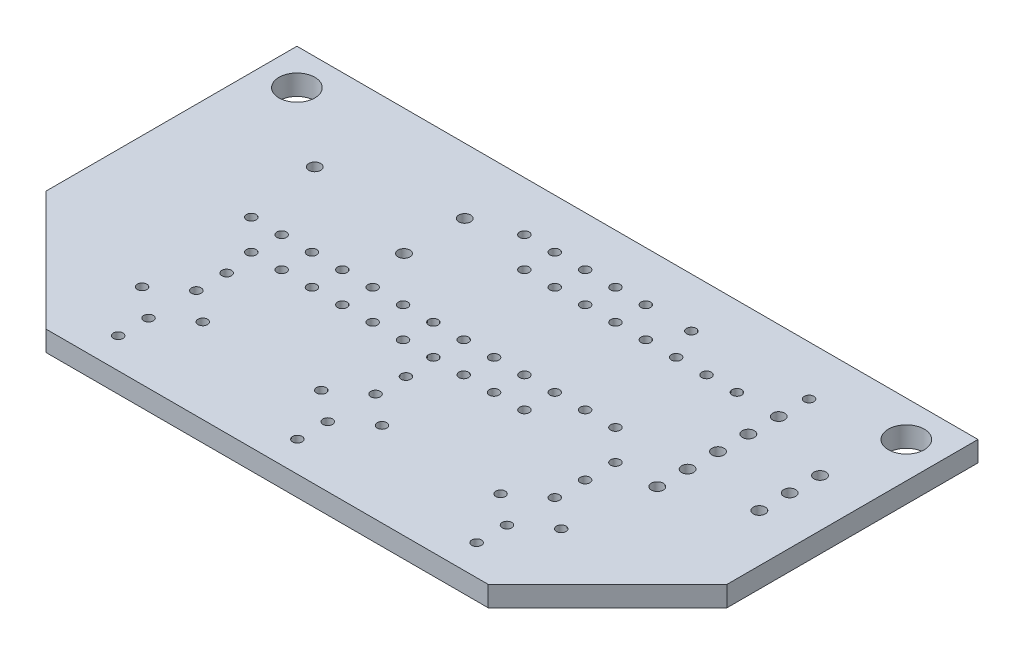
ISO-10303-21;
HEADER;
FILE_DESCRIPTION(('STEP AP214'),'2;1');
FILE_NAME('part.step','',(''),(''),'','','');
FILE_SCHEMA(('AUTOMOTIVE_DESIGN { 1 0 10303 214 1 1 1 1 }'));
ENDSEC;
DATA;
#1=APPLICATION_CONTEXT('core data for automotive mechanical design processes');
#2=APPLICATION_PROTOCOL_DEFINITION('international standard','automotive_design',2000,#1);
#3=PRODUCT_CONTEXT('',#1,'mechanical');
#4=PRODUCT('Part','Part','',(#3));
#5=PRODUCT_RELATED_PRODUCT_CATEGORY('part','',(#4));
#6=PRODUCT_DEFINITION_FORMATION('','',#4);
#7=PRODUCT_DEFINITION_CONTEXT('part definition',#1,'design');
#8=PRODUCT_DEFINITION('design','',#6,#7);
#9=PRODUCT_DEFINITION_SHAPE('','',#8);
#10=(LENGTH_UNIT() NAMED_UNIT(*) SI_UNIT(.MILLI.,.METRE.));
#11=(NAMED_UNIT(*) PLANE_ANGLE_UNIT() SI_UNIT($,.RADIAN.));
#12=(NAMED_UNIT(*) SI_UNIT($,.STERADIAN.) SOLID_ANGLE_UNIT());
#13=UNCERTAINTY_MEASURE_WITH_UNIT(LENGTH_MEASURE(1.E-05),#10,'distance_accuracy_value','');
#14=(GEOMETRIC_REPRESENTATION_CONTEXT(3) GLOBAL_UNCERTAINTY_ASSIGNED_CONTEXT((#13)) GLOBAL_UNIT_ASSIGNED_CONTEXT((#10,
#11,#12)) REPRESENTATION_CONTEXT('',''));
#15=CARTESIAN_POINT('',(0.,0.,0.));
#16=DIRECTION('',(0.,0.,1.));
#17=DIRECTION('',(1.,0.,0.));
#18=AXIS2_PLACEMENT_3D('',#15,#16,#17);
#19=CARTESIAN_POINT('',(-28.5,1.7,0.));
#20=DIRECTION('',(0.,-1.,0.));
#21=DIRECTION('',(0.,0.,-1.));
#22=AXIS2_PLACEMENT_3D('',#19,#20,#21);
#23=PLANE('',#22);
#24=CARTESIAN_POINT('',(-5.32000000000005,1.7,-26.8599999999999));
#25=DIRECTION('',(0.,1.,0.));
#26=DIRECTION('',(0.,0.,1.));
#27=AXIS2_PLACEMENT_3D('',#24,#25,#26);
#28=CIRCLE('',#27,0.399999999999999);
#29=CARTESIAN_POINT('',(-5.32000000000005,1.7,-26.4599999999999));
#30=VERTEX_POINT('',#29);
#31=EDGE_CURVE('E458',#30,#30,#28,.T.);
#32=ORIENTED_EDGE('',*,*,#31,.F.);
#33=EDGE_LOOP('',(#32));
#34=FACE_BOUND('',#33,.T.);
#35=CARTESIAN_POINT('',(-0.240000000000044,1.7,-26.8599999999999));
#36=DIRECTION('',(0.,1.,0.));
#37=DIRECTION('',(0.,0.,1.));
#38=AXIS2_PLACEMENT_3D('',#35,#36,#37);
#39=CIRCLE('',#38,0.399999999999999);
#40=CARTESIAN_POINT('',(-0.240000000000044,1.7,-26.4599999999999));
#41=VERTEX_POINT('',#40);
#42=EDGE_CURVE('E470',#41,#41,#39,.T.);
#43=ORIENTED_EDGE('',*,*,#42,.F.);
#44=EDGE_LOOP('',(#43));
#45=FACE_BOUND('',#44,.T.);
#46=CARTESIAN_POINT('',(4.83999999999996,1.7,-26.8599999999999));
#47=DIRECTION('',(0.,1.,0.));
#48=DIRECTION('',(0.,0.,1.));
#49=AXIS2_PLACEMENT_3D('',#46,#47,#48);
#50=CIRCLE('',#49,0.399999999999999);
#51=CARTESIAN_POINT('',(4.83999999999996,1.7,-26.4599999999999));
#52=VERTEX_POINT('',#51);
#53=EDGE_CURVE('E482',#52,#52,#50,.T.);
#54=ORIENTED_EDGE('',*,*,#53,.F.);
#55=EDGE_LOOP('',(#54));
#56=FACE_BOUND('',#55,.T.);
#57=CARTESIAN_POINT('',(-2.78000000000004,1.7,-24.3199999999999));
#58=DIRECTION('',(0.,1.,0.));
#59=DIRECTION('',(0.,0.,1.));
#60=AXIS2_PLACEMENT_3D('',#57,#58,#59);
#61=CIRCLE('',#60,0.399999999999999);
#62=CARTESIAN_POINT('',(-2.78000000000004,1.7,-23.9199999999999));
#63=VERTEX_POINT('',#62);
#64=EDGE_CURVE('E494',#63,#63,#61,.T.);
#65=ORIENTED_EDGE('',*,*,#64,.F.);
#66=EDGE_LOOP('',(#65));
#67=FACE_BOUND('',#66,.T.);
#68=CARTESIAN_POINT('',(-2.78000000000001,1.7,-16.6999999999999));
#69=DIRECTION('',(0.,1.,0.));
#70=DIRECTION('',(0.,0.,1.));
#71=AXIS2_PLACEMENT_3D('',#68,#69,#70);
#72=CIRCLE('',#71,0.399999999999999);
#73=CARTESIAN_POINT('',(-2.78000000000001,1.7,-16.2999999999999));
#74=VERTEX_POINT('',#73);
#75=EDGE_CURVE('E506',#74,#74,#72,.T.);
#76=ORIENTED_EDGE('',*,*,#75,.F.);
#77=EDGE_LOOP('',(#76));
#78=FACE_BOUND('',#77,.T.);
#79=CARTESIAN_POINT('',(-0.240000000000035,1.7,-24.3199999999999));
#80=DIRECTION('',(0.,1.,0.));
#81=DIRECTION('',(0.,0.,1.));
#82=AXIS2_PLACEMENT_3D('',#79,#80,#81);
#83=CIRCLE('',#82,0.399999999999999);
#84=CARTESIAN_POINT('',(-0.240000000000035,1.7,-23.9199999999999));
#85=VERTEX_POINT('',#84);
#86=EDGE_CURVE('E518',#85,#85,#83,.T.);
#87=ORIENTED_EDGE('',*,*,#86,.F.);
#88=EDGE_LOOP('',(#87));
#89=FACE_BOUND('',#88,.T.);
#90=CARTESIAN_POINT('',(-9.,1.7,-20.46));
#91=DIRECTION('',(0.,1.,0.));
#92=DIRECTION('',(0.,0.,1.));
#93=AXIS2_PLACEMENT_3D('',#90,#91,#92);
#94=CIRCLE('',#93,0.500000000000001);
#95=CARTESIAN_POINT('',(-9.,1.7,-19.96));
#96=VERTEX_POINT('',#95);
#97=EDGE_CURVE('E530',#96,#96,#94,.T.);
#98=ORIENTED_EDGE('',*,*,#97,.F.);
#99=EDGE_LOOP('',(#98));
#100=FACE_BOUND('',#99,.T.);
#101=CARTESIAN_POINT('',(-0.240000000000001,1.7,-14.1599999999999));
#102=DIRECTION('',(0.,1.,0.));
#103=DIRECTION('',(0.,0.,1.));
#104=AXIS2_PLACEMENT_3D('',#101,#102,#103);
#105=CIRCLE('',#104,0.399999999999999);
#106=CARTESIAN_POINT('',(-0.240000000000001,1.7,-13.7599999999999));
#107=VERTEX_POINT('',#106);
#108=EDGE_CURVE('E542',#107,#107,#105,.T.);
#109=ORIENTED_EDGE('',*,*,#108,.F.);
#110=EDGE_LOOP('',(#109));
#111=FACE_BOUND('',#110,.T.);
#112=CARTESIAN_POINT('',(2.29999999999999,1.7,-16.6999999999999));
#113=DIRECTION('',(0.,1.,0.));
#114=DIRECTION('',(0.,0.,1.));
#115=AXIS2_PLACEMENT_3D('',#112,#113,#114);
#116=CIRCLE('',#115,0.399999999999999);
#117=CARTESIAN_POINT('',(2.29999999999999,1.7,-16.2999999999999));
#118=VERTEX_POINT('',#117);
#119=EDGE_CURVE('E554',#118,#118,#116,.T.);
#120=ORIENTED_EDGE('',*,*,#119,.F.);
#121=EDGE_LOOP('',(#120));
#122=FACE_BOUND('',#121,.T.);
#123=CARTESIAN_POINT('',(4.83999999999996,1.7,-24.3199999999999));
#124=DIRECTION('',(0.,1.,0.));
#125=DIRECTION('',(0.,0.,1.));
#126=AXIS2_PLACEMENT_3D('',#123,#124,#125);
#127=CIRCLE('',#126,0.399999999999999);
#128=CARTESIAN_POINT('',(4.83999999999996,1.7,-23.9199999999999));
#129=VERTEX_POINT('',#128);
#130=EDGE_CURVE('E566',#129,#129,#127,.T.);
#131=ORIENTED_EDGE('',*,*,#130,.F.);
#132=EDGE_LOOP('',(#131));
#133=FACE_BOUND('',#132,.T.);
#134=CARTESIAN_POINT('',(4.83999999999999,1.7,-16.6999999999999));
#135=DIRECTION('',(0.,1.,0.));
#136=DIRECTION('',(0.,0.,1.));
#137=AXIS2_PLACEMENT_3D('',#134,#135,#136);
#138=CIRCLE('',#137,0.399999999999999);
#139=CARTESIAN_POINT('',(4.83999999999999,1.7,-16.2999999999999));
#140=VERTEX_POINT('',#139);
#141=EDGE_CURVE('E578',#140,#140,#138,.T.);
#142=ORIENTED_EDGE('',*,*,#141,.F.);
#143=EDGE_LOOP('',(#142));
#144=FACE_BOUND('',#143,.T.);
#145=CARTESIAN_POINT('',(7.37999999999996,1.7,-24.32));
#146=DIRECTION('',(0.,1.,0.));
#147=DIRECTION('',(0.,0.,1.));
#148=AXIS2_PLACEMENT_3D('',#145,#146,#147);
#149=CIRCLE('',#148,0.399999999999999);
#150=CARTESIAN_POINT('',(7.37999999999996,1.7,-23.92));
#151=VERTEX_POINT('',#150);
#152=EDGE_CURVE('E590',#151,#151,#149,.T.);
#153=ORIENTED_EDGE('',*,*,#152,.F.);
#154=EDGE_LOOP('',(#153));
#155=FACE_BOUND('',#154,.T.);
#156=CARTESIAN_POINT('',(7.37999999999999,1.7,-16.6999999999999));
#157=DIRECTION('',(0.,1.,0.));
#158=DIRECTION('',(0.,0.,1.));
#159=AXIS2_PLACEMENT_3D('',#156,#157,#158);
#160=CIRCLE('',#159,0.399999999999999);
#161=CARTESIAN_POINT('',(7.37999999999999,1.7,-16.3));
#162=VERTEX_POINT('',#161);
#163=EDGE_CURVE('E602',#162,#162,#160,.T.);
#164=ORIENTED_EDGE('',*,*,#163,.F.);
#165=EDGE_LOOP('',(#164));
#166=FACE_BOUND('',#165,.T.);
#167=CARTESIAN_POINT('',(9.91999999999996,1.7,-24.32));
#168=DIRECTION('',(0.,1.,0.));
#169=DIRECTION('',(0.,0.,1.));
#170=AXIS2_PLACEMENT_3D('',#167,#168,#169);
#171=CIRCLE('',#170,0.400000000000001);
#172=CARTESIAN_POINT('',(9.91999999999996,1.7,-23.92));
#173=VERTEX_POINT('',#172);
#174=EDGE_CURVE('E614',#173,#173,#171,.T.);
#175=ORIENTED_EDGE('',*,*,#174,.F.);
#176=EDGE_LOOP('',(#175));
#177=FACE_BOUND('',#176,.T.);
#178=CARTESIAN_POINT('',(-12.94,1.7,-16.6999999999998));
#179=DIRECTION('',(0.,1.,0.));
#180=DIRECTION('',(0.,0.,1.));
#181=AXIS2_PLACEMENT_3D('',#178,#179,#180);
#182=CIRCLE('',#181,0.399999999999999);
#183=CARTESIAN_POINT('',(-12.94,1.7,-16.2999999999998));
#184=VERTEX_POINT('',#183);
#185=EDGE_CURVE('E626',#184,#184,#182,.T.);
#186=ORIENTED_EDGE('',*,*,#185,.F.);
#187=EDGE_LOOP('',(#186));
#188=FACE_BOUND('',#187,.T.);
#189=CARTESIAN_POINT('',(-12.94,1.7,-14.1599999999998));
#190=DIRECTION('',(0.,1.,0.));
#191=DIRECTION('',(0.,0.,1.));
#192=AXIS2_PLACEMENT_3D('',#189,#190,#191);
#193=CIRCLE('',#192,0.399999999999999);
#194=CARTESIAN_POINT('',(-12.94,1.7,-13.7599999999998));
#195=VERTEX_POINT('',#194);
#196=EDGE_CURVE('E638',#195,#195,#193,.T.);
#197=ORIENTED_EDGE('',*,*,#196,.F.);
#198=EDGE_LOOP('',(#197));
#199=FACE_BOUND('',#198,.T.);
#200=CARTESIAN_POINT('',(-10.4,1.7,-16.6999999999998));
#201=DIRECTION('',(0.,1.,0.));
#202=DIRECTION('',(0.,0.,1.));
#203=AXIS2_PLACEMENT_3D('',#200,#201,#202);
#204=CIRCLE('',#203,0.399999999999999);
#205=CARTESIAN_POINT('',(-10.4,1.7,-16.2999999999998));
#206=VERTEX_POINT('',#205);
#207=EDGE_CURVE('E650',#206,#206,#204,.T.);
#208=ORIENTED_EDGE('',*,*,#207,.F.);
#209=EDGE_LOOP('',(#208));
#210=FACE_BOUND('',#209,.T.);
#211=CARTESIAN_POINT('',(12.46,1.7,-16.7));
#212=DIRECTION('',(0.,1.,0.));
#213=DIRECTION('',(0.,0.,1.));
#214=AXIS2_PLACEMENT_3D('',#211,#212,#213);
#215=CIRCLE('',#214,0.399999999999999);
#216=CARTESIAN_POINT('',(12.46,1.7,-16.3));
#217=VERTEX_POINT('',#216);
#218=EDGE_CURVE('E662',#217,#217,#215,.T.);
#219=ORIENTED_EDGE('',*,*,#218,.F.);
#220=EDGE_LOOP('',(#219));
#221=FACE_BOUND('',#220,.T.);
#222=CARTESIAN_POINT('',(-7.86,1.7,-14.1599999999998));
#223=DIRECTION('',(0.,1.,0.));
#224=DIRECTION('',(0.,0.,1.));
#225=AXIS2_PLACEMENT_3D('',#222,#223,#224);
#226=CIRCLE('',#225,0.4);
#227=CARTESIAN_POINT('',(-7.86,1.7,-13.7599999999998));
#228=VERTEX_POINT('',#227);
#229=EDGE_CURVE('E674',#228,#228,#226,.T.);
#230=ORIENTED_EDGE('',*,*,#229,.F.);
#231=EDGE_LOOP('',(#230));
#232=FACE_BOUND('',#231,.T.);
#233=CARTESIAN_POINT('',(24.5,1.7,-19.24));
#234=DIRECTION('',(0.,1.,0.));
#235=DIRECTION('',(0.,0.,1.));
#236=AXIS2_PLACEMENT_3D('',#233,#234,#235);
#237=CIRCLE('',#236,0.499999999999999);
#238=CARTESIAN_POINT('',(24.5,1.7,-18.74));
#239=VERTEX_POINT('',#238);
#240=EDGE_CURVE('E686',#239,#239,#237,.T.);
#241=ORIENTED_EDGE('',*,*,#240,.F.);
#242=EDGE_LOOP('',(#241));
#243=FACE_BOUND('',#242,.T.);
#244=CARTESIAN_POINT('',(18.5,1.7,-24.32));
#245=DIRECTION('',(0.,1.,0.));
#246=DIRECTION('',(0.,0.,1.));
#247=AXIS2_PLACEMENT_3D('',#244,#245,#246);
#248=CIRCLE('',#247,0.499999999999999);
#249=CARTESIAN_POINT('',(18.5,1.7,-23.82));
#250=VERTEX_POINT('',#249);
#251=EDGE_CURVE('E698',#250,#250,#248,.T.);
#252=ORIENTED_EDGE('',*,*,#251,.F.);
#253=EDGE_LOOP('',(#252));
#254=FACE_BOUND('',#253,.T.);
#255=CARTESIAN_POINT('',(18.5,1.7,-21.78));
#256=DIRECTION('',(0.,1.,0.));
#257=DIRECTION('',(0.,0.,1.));
#258=AXIS2_PLACEMENT_3D('',#255,#256,#257);
#259=CIRCLE('',#258,0.499999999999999);
#260=CARTESIAN_POINT('',(18.5,1.7,-21.28));
#261=VERTEX_POINT('',#260);
#262=EDGE_CURVE('E710',#261,#261,#259,.T.);
#263=ORIENTED_EDGE('',*,*,#262,.F.);
#264=EDGE_LOOP('',(#263));
#265=FACE_BOUND('',#264,.T.);
#266=CARTESIAN_POINT('',(18.5,1.7,-19.24));
#267=DIRECTION('',(0.,1.,0.));
#268=DIRECTION('',(0.,0.,1.));
#269=AXIS2_PLACEMENT_3D('',#266,#267,#268);
#270=CIRCLE('',#269,0.499999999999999);
#271=CARTESIAN_POINT('',(18.5,1.7,-18.74));
#272=VERTEX_POINT('',#271);
#273=EDGE_CURVE('E722',#272,#272,#270,.T.);
#274=ORIENTED_EDGE('',*,*,#273,.F.);
#275=EDGE_LOOP('',(#274));
#276=FACE_BOUND('',#275,.T.);
#277=CARTESIAN_POINT('',(18.5,1.7,-16.7));
#278=DIRECTION('',(0.,1.,0.));
#279=DIRECTION('',(0.,0.,1.));
#280=AXIS2_PLACEMENT_3D('',#277,#278,#279);
#281=CIRCLE('',#280,0.499999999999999);
#282=CARTESIAN_POINT('',(18.5,1.7,-16.2));
#283=VERTEX_POINT('',#282);
#284=EDGE_CURVE('E734',#283,#283,#281,.T.);
#285=ORIENTED_EDGE('',*,*,#284,.F.);
#286=EDGE_LOOP('',(#285));
#287=FACE_BOUND('',#286,.T.);
#288=CARTESIAN_POINT('',(15.,1.7,-14.16));
#289=DIRECTION('',(0.,1.,0.));
#290=DIRECTION('',(0.,0.,1.));
#291=AXIS2_PLACEMENT_3D('',#288,#289,#290);
#292=CIRCLE('',#291,0.399999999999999);
#293=CARTESIAN_POINT('',(15.,1.7,-13.76));
#294=VERTEX_POINT('',#293);
#295=EDGE_CURVE('E746',#294,#294,#292,.T.);
#296=ORIENTED_EDGE('',*,*,#295,.F.);
#297=EDGE_LOOP('',(#296));
#298=FACE_BOUND('',#297,.T.);
#299=CARTESIAN_POINT('',(25.5,1.7,-28.));
#300=DIRECTION('',(0.,1.,0.));
#301=DIRECTION('',(0.,0.,1.));
#302=AXIS2_PLACEMENT_3D('',#299,#300,#301);
#303=CIRCLE('',#302,1.5);
#304=CARTESIAN_POINT('',(25.5,1.7,-26.5));
#305=VERTEX_POINT('',#304);
#306=EDGE_CURVE('E758',#305,#305,#303,.T.);
#307=ORIENTED_EDGE('',*,*,#306,.F.);
#308=EDGE_LOOP('',(#307));
#309=FACE_BOUND('',#308,.T.);
#310=CARTESIAN_POINT('',(-15.,1.7,-5.08));
#311=DIRECTION('',(0.,1.,0.));
#312=DIRECTION('',(0.,0.,-1.));
#313=AXIS2_PLACEMENT_3D('',#310,#311,#312);
#314=CIRCLE('',#313,0.4);
#315=CARTESIAN_POINT('',(-15.,1.7,-5.48));
#316=VERTEX_POINT('',#315);
#317=EDGE_CURVE('E770',#316,#316,#314,.T.);
#318=ORIENTED_EDGE('',*,*,#317,.F.);
#319=EDGE_LOOP('',(#318));
#320=FACE_BOUND('',#319,.T.);
#321=CARTESIAN_POINT('',(-15.,1.7,-9.08));
#322=DIRECTION('',(0.,1.,0.));
#323=DIRECTION('',(0.,0.,-1.));
#324=AXIS2_PLACEMENT_3D('',#321,#322,#323);
#325=CIRCLE('',#324,0.399999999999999);
#326=CARTESIAN_POINT('',(-15.,1.7,-9.48));
#327=VERTEX_POINT('',#326);
#328=EDGE_CURVE('E782',#327,#327,#325,.T.);
#329=ORIENTED_EDGE('',*,*,#328,.F.);
#330=EDGE_LOOP('',(#329));
#331=FACE_BOUND('',#330,.T.);
#332=CARTESIAN_POINT('',(17.54,1.7,-7.08));
#333=DIRECTION('',(0.,1.,0.));
#334=DIRECTION('',(0.,0.,1.));
#335=AXIS2_PLACEMENT_3D('',#332,#333,#334);
#336=CIRCLE('',#335,0.400000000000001);
#337=CARTESIAN_POINT('',(17.54,1.7,-6.68));
#338=VERTEX_POINT('',#337);
#339=EDGE_CURVE('E794',#338,#338,#336,.T.);
#340=ORIENTED_EDGE('',*,*,#339,.F.);
#341=EDGE_LOOP('',(#340));
#342=FACE_BOUND('',#341,.T.);
#343=CARTESIAN_POINT('',(15.,1.7,-11.62));
#344=DIRECTION('',(0.,1.,0.));
#345=DIRECTION('',(0.,0.,1.));
#346=AXIS2_PLACEMENT_3D('',#343,#344,#345);
#347=CIRCLE('',#346,0.399999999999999);
#348=CARTESIAN_POINT('',(15.,1.7,-11.22));
#349=VERTEX_POINT('',#348);
#350=EDGE_CURVE('E806',#349,#349,#347,.T.);
#351=ORIENTED_EDGE('',*,*,#350,.F.);
#352=EDGE_LOOP('',(#351));
#353=FACE_BOUND('',#352,.T.);
#354=CARTESIAN_POINT('',(15.,1.7,-5.08));
#355=DIRECTION('',(0.,1.,0.));
#356=DIRECTION('',(0.,0.,1.));
#357=AXIS2_PLACEMENT_3D('',#354,#355,#356);
#358=CIRCLE('',#357,0.4);
#359=CARTESIAN_POINT('',(15.,1.7,-4.68));
#360=VERTEX_POINT('',#359);
#361=EDGE_CURVE('E818',#360,#360,#358,.T.);
#362=ORIENTED_EDGE('',*,*,#361,.F.);
#363=EDGE_LOOP('',(#362));
#364=FACE_BOUND('',#363,.T.);
#365=CARTESIAN_POINT('',(-15.,1.7,-11.62));
#366=DIRECTION('',(0.,1.,0.));
#367=DIRECTION('',(0.,0.,-1.));
#368=AXIS2_PLACEMENT_3D('',#365,#366,#367);
#369=CIRCLE('',#368,0.399999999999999);
#370=CARTESIAN_POINT('',(-15.,1.7,-12.02));
#371=VERTEX_POINT('',#370);
#372=EDGE_CURVE('E830',#371,#371,#369,.T.);
#373=ORIENTED_EDGE('',*,*,#372,.F.);
#374=EDGE_LOOP('',(#373));
#375=FACE_BOUND('',#374,.T.);
#376=CARTESIAN_POINT('',(-2.54,1.7,-7.08));
#377=DIRECTION('',(0.,1.,0.));
#378=DIRECTION('',(0.,0.,1.));
#379=AXIS2_PLACEMENT_3D('',#376,#377,#378);
#380=CIRCLE('',#379,0.4);
#381=CARTESIAN_POINT('',(-2.54,1.7,-6.68));
#382=VERTEX_POINT('',#381);
#383=EDGE_CURVE('E842',#382,#382,#380,.T.);
#384=ORIENTED_EDGE('',*,*,#383,.F.);
#385=EDGE_LOOP('',(#384));
#386=FACE_BOUND('',#385,.T.);
#387=CARTESIAN_POINT('',(0.,1.7,-9.08));
#388=DIRECTION('',(0.,1.,0.));
#389=DIRECTION('',(0.,0.,1.));
#390=AXIS2_PLACEMENT_3D('',#387,#388,#389);
#391=CIRCLE('',#390,0.4);
#392=CARTESIAN_POINT('',(0.,1.7,-8.68));
#393=VERTEX_POINT('',#392);
#394=EDGE_CURVE('E854',#393,#393,#391,.T.);
#395=ORIENTED_EDGE('',*,*,#394,.F.);
#396=EDGE_LOOP('',(#395));
#397=FACE_BOUND('',#396,.T.);
#398=CARTESIAN_POINT('',(0.,1.7,-2.54));
#399=DIRECTION('',(0.,1.,0.));
#400=DIRECTION('',(0.,0.,1.));
#401=AXIS2_PLACEMENT_3D('',#398,#399,#400);
#402=CIRCLE('',#401,0.4);
#403=CARTESIAN_POINT('',(0.,1.7,-2.14));
#404=VERTEX_POINT('',#403);
#405=EDGE_CURVE('E126',#404,#404,#402,.T.);
#406=ORIENTED_EDGE('',*,*,#405,.F.);
#407=EDGE_LOOP('',(#406));
#408=FACE_BOUND('',#407,.T.);
#409=DIRECTION('',(1.,0.,0.));
#410=VECTOR('',#409,1.);
#411=CARTESIAN_POINT('',(18.5,1.7,0.));
#412=LINE('',#411,#410);
#413=CARTESIAN_POINT('',(-18.5,1.7,0.));
#414=VERTEX_POINT('',#413);
#415=CARTESIAN_POINT('',(18.5,1.7,0.));
#416=VERTEX_POINT('',#415);
#417=EDGE_CURVE('E133',#414,#416,#412,.T.);
#418=ORIENTED_EDGE('',*,*,#417,.T.);
#419=DIRECTION('',(0.707106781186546,0.,-0.707106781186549));
#420=VECTOR('',#419,1.);
#421=CARTESIAN_POINT('',(18.5,1.7,0.));
#422=LINE('',#421,#420);
#423=CARTESIAN_POINT('',(28.5,1.7,-10.));
#424=VERTEX_POINT('',#423);
#425=EDGE_CURVE('E91',#416,#424,#422,.T.);
#426=ORIENTED_EDGE('',*,*,#425,.T.);
#427=DIRECTION('',(0.,0.,-1.));
#428=VECTOR('',#427,1.);
#429=CARTESIAN_POINT('',(28.5,1.7,-31.));
#430=LINE('',#429,#428);
#431=CARTESIAN_POINT('',(28.5,1.7,-31.));
#432=VERTEX_POINT('',#431);
#433=EDGE_CURVE('E104',#424,#432,#430,.T.);
#434=ORIENTED_EDGE('',*,*,#433,.T.);
#435=DIRECTION('',(-1.,0.,0.));
#436=VECTOR('',#435,1.);
#437=CARTESIAN_POINT('',(-28.5,1.7,-31.));
#438=LINE('',#437,#436);
#439=CARTESIAN_POINT('',(-28.5,1.7,-31.));
#440=VERTEX_POINT('',#439);
#441=EDGE_CURVE('E98',#432,#440,#438,.T.);
#442=ORIENTED_EDGE('',*,*,#441,.T.);
#443=DIRECTION('',(0.,0.,1.));
#444=VECTOR('',#443,1.);
#445=CARTESIAN_POINT('',(-28.5,1.7,-10.));
#446=LINE('',#445,#444);
#447=CARTESIAN_POINT('',(-28.5,1.7,-10.));
#448=VERTEX_POINT('',#447);
#449=EDGE_CURVE('E102',#440,#448,#446,.T.);
#450=ORIENTED_EDGE('',*,*,#449,.T.);
#451=DIRECTION('',(0.707106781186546,0.,0.707106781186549));
#452=VECTOR('',#451,1.);
#453=CARTESIAN_POINT('',(-18.5,1.7,0.));
#454=LINE('',#453,#452);
#455=EDGE_CURVE('E54',#448,#414,#454,.T.);
#456=ORIENTED_EDGE('',*,*,#455,.T.);
#457=EDGE_LOOP('',(#418,#426,#434,#442,#450,#456));
#458=FACE_BOUND('',#457,.T.);
#459=CARTESIAN_POINT('',(0.,1.7,-5.08));
#460=DIRECTION('',(0.,1.,0.));
#461=DIRECTION('',(0.,0.,1.));
#462=AXIS2_PLACEMENT_3D('',#459,#460,#461);
#463=CIRCLE('',#462,0.4);
#464=CARTESIAN_POINT('',(0.,1.7,-4.68));
#465=VERTEX_POINT('',#464);
#466=EDGE_CURVE('E860',#465,#465,#463,.T.);
#467=ORIENTED_EDGE('',*,*,#466,.F.);
#468=EDGE_LOOP('',(#467));
#469=FACE_BOUND('',#468,.T.);
#470=CARTESIAN_POINT('',(0.,1.7,-11.62));
#471=DIRECTION('',(0.,1.,0.));
#472=DIRECTION('',(0.,0.,1.));
#473=AXIS2_PLACEMENT_3D('',#470,#471,#472);
#474=CIRCLE('',#473,0.4);
#475=CARTESIAN_POINT('',(0.,1.7,-11.22));
#476=VERTEX_POINT('',#475);
#477=EDGE_CURVE('E848',#476,#476,#474,.T.);
#478=ORIENTED_EDGE('',*,*,#477,.F.);
#479=EDGE_LOOP('',(#478));
#480=FACE_BOUND('',#479,.T.);
#481=CARTESIAN_POINT('',(2.54,1.7,-7.08));
#482=DIRECTION('',(0.,1.,0.));
#483=DIRECTION('',(0.,0.,1.));
#484=AXIS2_PLACEMENT_3D('',#481,#482,#483);
#485=CIRCLE('',#484,0.4);
#486=CARTESIAN_POINT('',(2.54,1.7,-6.68));
#487=VERTEX_POINT('',#486);
#488=EDGE_CURVE('E836',#487,#487,#485,.T.);
#489=ORIENTED_EDGE('',*,*,#488,.F.);
#490=EDGE_LOOP('',(#489));
#491=FACE_BOUND('',#490,.T.);
#492=CARTESIAN_POINT('',(15.,1.7,-2.54));
#493=DIRECTION('',(0.,1.,0.));
#494=DIRECTION('',(0.,0.,1.));
#495=AXIS2_PLACEMENT_3D('',#492,#493,#494);
#496=CIRCLE('',#495,0.4);
#497=CARTESIAN_POINT('',(15.,1.7,-2.14));
#498=VERTEX_POINT('',#497);
#499=EDGE_CURVE('E824',#498,#498,#496,.T.);
#500=ORIENTED_EDGE('',*,*,#499,.F.);
#501=EDGE_LOOP('',(#500));
#502=FACE_BOUND('',#501,.T.);
#503=CARTESIAN_POINT('',(15.,1.7,-9.08));
#504=DIRECTION('',(0.,1.,0.));
#505=DIRECTION('',(0.,0.,1.));
#506=AXIS2_PLACEMENT_3D('',#503,#504,#505);
#507=CIRCLE('',#506,0.399999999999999);
#508=CARTESIAN_POINT('',(15.,1.7,-8.68));
#509=VERTEX_POINT('',#508);
#510=EDGE_CURVE('E812',#509,#509,#507,.T.);
#511=ORIENTED_EDGE('',*,*,#510,.F.);
#512=EDGE_LOOP('',(#511));
#513=FACE_BOUND('',#512,.T.);
#514=CARTESIAN_POINT('',(12.46,1.7,-7.08));
#515=DIRECTION('',(0.,1.,0.));
#516=DIRECTION('',(0.,0.,1.));
#517=AXIS2_PLACEMENT_3D('',#514,#515,#516);
#518=CIRCLE('',#517,0.400000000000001);
#519=CARTESIAN_POINT('',(12.46,1.7,-6.68));
#520=VERTEX_POINT('',#519);
#521=EDGE_CURVE('E800',#520,#520,#518,.T.);
#522=ORIENTED_EDGE('',*,*,#521,.F.);
#523=EDGE_LOOP('',(#522));
#524=FACE_BOUND('',#523,.T.);
#525=CARTESIAN_POINT('',(-12.46,1.7,-7.08));
#526=DIRECTION('',(0.,1.,0.));
#527=DIRECTION('',(0.,0.,-1.));
#528=AXIS2_PLACEMENT_3D('',#525,#526,#527);
#529=CIRCLE('',#528,0.400000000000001);
#530=CARTESIAN_POINT('',(-12.46,1.7,-7.48));
#531=VERTEX_POINT('',#530);
#532=EDGE_CURVE('E788',#531,#531,#529,.T.);
#533=ORIENTED_EDGE('',*,*,#532,.F.);
#534=EDGE_LOOP('',(#533));
#535=FACE_BOUND('',#534,.T.);
#536=CARTESIAN_POINT('',(-17.54,1.7,-7.08));
#537=DIRECTION('',(0.,1.,0.));
#538=DIRECTION('',(0.,0.,-1.));
#539=AXIS2_PLACEMENT_3D('',#536,#537,#538);
#540=CIRCLE('',#539,0.400000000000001);
#541=CARTESIAN_POINT('',(-17.54,1.7,-7.48));
#542=VERTEX_POINT('',#541);
#543=EDGE_CURVE('E776',#542,#542,#540,.T.);
#544=ORIENTED_EDGE('',*,*,#543,.F.);
#545=EDGE_LOOP('',(#544));
#546=FACE_BOUND('',#545,.T.);
#547=CARTESIAN_POINT('',(-15.,1.7,-2.54));
#548=DIRECTION('',(0.,1.,0.));
#549=DIRECTION('',(0.,0.,-1.));
#550=AXIS2_PLACEMENT_3D('',#547,#548,#549);
#551=CIRCLE('',#550,0.4);
#552=CARTESIAN_POINT('',(-15.,1.7,-2.94));
#553=VERTEX_POINT('',#552);
#554=EDGE_CURVE('E764',#553,#553,#551,.T.);
#555=ORIENTED_EDGE('',*,*,#554,.F.);
#556=EDGE_LOOP('',(#555));
#557=FACE_BOUND('',#556,.T.);
#558=CARTESIAN_POINT('',(-25.5,1.7,-28.));
#559=DIRECTION('',(0.,1.,0.));
#560=DIRECTION('',(0.,0.,-1.));
#561=AXIS2_PLACEMENT_3D('',#558,#559,#560);
#562=CIRCLE('',#561,1.5);
#563=CARTESIAN_POINT('',(-25.5,1.7,-29.5));
#564=VERTEX_POINT('',#563);
#565=EDGE_CURVE('E752',#564,#564,#562,.T.);
#566=ORIENTED_EDGE('',*,*,#565,.F.);
#567=EDGE_LOOP('',(#566));
#568=FACE_BOUND('',#567,.T.);
#569=CARTESIAN_POINT('',(18.5,1.7,-14.16));
#570=DIRECTION('',(0.,1.,0.));
#571=DIRECTION('',(0.,0.,1.));
#572=AXIS2_PLACEMENT_3D('',#569,#570,#571);
#573=CIRCLE('',#572,0.499999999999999);
#574=CARTESIAN_POINT('',(18.5,1.7,-13.66));
#575=VERTEX_POINT('',#574);
#576=EDGE_CURVE('E740',#575,#575,#573,.T.);
#577=ORIENTED_EDGE('',*,*,#576,.F.);
#578=EDGE_LOOP('',(#577));
#579=FACE_BOUND('',#578,.T.);
#580=CARTESIAN_POINT('',(-5.32,1.7,-14.1599999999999));
#581=DIRECTION('',(0.,1.,0.));
#582=DIRECTION('',(0.,0.,1.));
#583=AXIS2_PLACEMENT_3D('',#580,#581,#582);
#584=CIRCLE('',#583,0.399999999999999);
#585=CARTESIAN_POINT('',(-5.32,1.7,-13.7599999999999));
#586=VERTEX_POINT('',#585);
#587=EDGE_CURVE('E728',#586,#586,#584,.T.);
#588=ORIENTED_EDGE('',*,*,#587,.F.);
#589=EDGE_LOOP('',(#588));
#590=FACE_BOUND('',#589,.T.);
#591=CARTESIAN_POINT('',(-5.32000000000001,1.7,-16.6999999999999));
#592=DIRECTION('',(0.,1.,0.));
#593=DIRECTION('',(0.,0.,1.));
#594=AXIS2_PLACEMENT_3D('',#591,#592,#593);
#595=CIRCLE('',#594,0.399999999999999);
#596=CARTESIAN_POINT('',(-5.32000000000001,1.7,-16.2999999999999));
#597=VERTEX_POINT('',#596);
#598=EDGE_CURVE('E716',#597,#597,#595,.T.);
#599=ORIENTED_EDGE('',*,*,#598,.F.);
#600=EDGE_LOOP('',(#599));
#601=FACE_BOUND('',#600,.T.);
#602=CARTESIAN_POINT('',(15.,1.7,-24.32));
#603=DIRECTION('',(0.,1.,0.));
#604=DIRECTION('',(0.,0.,1.));
#605=AXIS2_PLACEMENT_3D('',#602,#603,#604);
#606=CIRCLE('',#605,0.399999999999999);
#607=CARTESIAN_POINT('',(15.,1.7,-23.92));
#608=VERTEX_POINT('',#607);
#609=EDGE_CURVE('E704',#608,#608,#606,.T.);
#610=ORIENTED_EDGE('',*,*,#609,.F.);
#611=EDGE_LOOP('',(#610));
#612=FACE_BOUND('',#611,.T.);
#613=CARTESIAN_POINT('',(24.5,1.7,-16.7));
#614=DIRECTION('',(0.,1.,0.));
#615=DIRECTION('',(0.,0.,1.));
#616=AXIS2_PLACEMENT_3D('',#613,#614,#615);
#617=CIRCLE('',#616,0.499999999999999);
#618=CARTESIAN_POINT('',(24.5,1.7,-16.2));
#619=VERTEX_POINT('',#618);
#620=EDGE_CURVE('E692',#619,#619,#617,.T.);
#621=ORIENTED_EDGE('',*,*,#620,.F.);
#622=EDGE_LOOP('',(#621));
#623=FACE_BOUND('',#622,.T.);
#624=CARTESIAN_POINT('',(24.5,1.7,-21.78));
#625=DIRECTION('',(0.,1.,0.));
#626=DIRECTION('',(0.,0.,1.));
#627=AXIS2_PLACEMENT_3D('',#624,#625,#626);
#628=CIRCLE('',#627,0.499999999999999);
#629=CARTESIAN_POINT('',(24.5,1.7,-21.28));
#630=VERTEX_POINT('',#629);
#631=EDGE_CURVE('E680',#630,#630,#628,.T.);
#632=ORIENTED_EDGE('',*,*,#631,.F.);
#633=EDGE_LOOP('',(#632));
#634=FACE_BOUND('',#633,.T.);
#635=CARTESIAN_POINT('',(-7.86000000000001,1.7,-16.6999999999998));
#636=DIRECTION('',(0.,1.,0.));
#637=DIRECTION('',(0.,0.,1.));
#638=AXIS2_PLACEMENT_3D('',#635,#636,#637);
#639=CIRCLE('',#638,0.399999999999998);
#640=CARTESIAN_POINT('',(-7.86000000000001,1.7,-16.2999999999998));
#641=VERTEX_POINT('',#640);
#642=EDGE_CURVE('E668',#641,#641,#639,.T.);
#643=ORIENTED_EDGE('',*,*,#642,.F.);
#644=EDGE_LOOP('',(#643));
#645=FACE_BOUND('',#644,.T.);
#646=CARTESIAN_POINT('',(-10.4,1.7,-14.1599999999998));
#647=DIRECTION('',(0.,1.,0.));
#648=DIRECTION('',(0.,0.,1.));
#649=AXIS2_PLACEMENT_3D('',#646,#647,#648);
#650=CIRCLE('',#649,0.399999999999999);
#651=CARTESIAN_POINT('',(-10.4,1.7,-13.7599999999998));
#652=VERTEX_POINT('',#651);
#653=EDGE_CURVE('E656',#652,#652,#650,.T.);
#654=ORIENTED_EDGE('',*,*,#653,.F.);
#655=EDGE_LOOP('',(#654));
#656=FACE_BOUND('',#655,.T.);
#657=CARTESIAN_POINT('',(12.46,1.7,-24.32));
#658=DIRECTION('',(0.,1.,0.));
#659=DIRECTION('',(0.,0.,1.));
#660=AXIS2_PLACEMENT_3D('',#657,#658,#659);
#661=CIRCLE('',#660,0.399999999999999);
#662=CARTESIAN_POINT('',(12.46,1.7,-23.92));
#663=VERTEX_POINT('',#662);
#664=EDGE_CURVE('E644',#663,#663,#661,.T.);
#665=ORIENTED_EDGE('',*,*,#664,.F.);
#666=EDGE_LOOP('',(#665));
#667=FACE_BOUND('',#666,.T.);
#668=CARTESIAN_POINT('',(9.91999999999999,1.7,-16.7));
#669=DIRECTION('',(0.,1.,0.));
#670=DIRECTION('',(0.,0.,1.));
#671=AXIS2_PLACEMENT_3D('',#668,#669,#670);
#672=CIRCLE('',#671,0.399999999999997);
#673=CARTESIAN_POINT('',(9.91999999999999,1.7,-16.3));
#674=VERTEX_POINT('',#673);
#675=EDGE_CURVE('E632',#674,#674,#672,.T.);
#676=ORIENTED_EDGE('',*,*,#675,.F.);
#677=EDGE_LOOP('',(#676));
#678=FACE_BOUND('',#677,.T.);
#679=CARTESIAN_POINT('',(-15.48,1.7,-14.1599999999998));
#680=DIRECTION('',(0.,1.,0.));
#681=DIRECTION('',(0.,0.,1.));
#682=AXIS2_PLACEMENT_3D('',#679,#680,#681);
#683=CIRCLE('',#682,0.399999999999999);
#684=CARTESIAN_POINT('',(-15.48,1.7,-13.7599999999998));
#685=VERTEX_POINT('',#684);
#686=EDGE_CURVE('E620',#685,#685,#683,.T.);
#687=ORIENTED_EDGE('',*,*,#686,.F.);
#688=EDGE_LOOP('',(#687));
#689=FACE_BOUND('',#688,.T.);
#690=CARTESIAN_POINT('',(7.38,1.7,-14.1599999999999));
#691=DIRECTION('',(0.,1.,0.));
#692=DIRECTION('',(0.,0.,1.));
#693=AXIS2_PLACEMENT_3D('',#690,#691,#692);
#694=CIRCLE('',#693,0.399999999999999);
#695=CARTESIAN_POINT('',(7.38,1.7,-13.7599999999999));
#696=VERTEX_POINT('',#695);
#697=EDGE_CURVE('E608',#696,#696,#694,.T.);
#698=ORIENTED_EDGE('',*,*,#697,.F.);
#699=EDGE_LOOP('',(#698));
#700=FACE_BOUND('',#699,.T.);
#701=CARTESIAN_POINT('',(-15.48,1.7,-16.6999999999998));
#702=DIRECTION('',(0.,1.,0.));
#703=DIRECTION('',(0.,0.,1.));
#704=AXIS2_PLACEMENT_3D('',#701,#702,#703);
#705=CIRCLE('',#704,0.399999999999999);
#706=CARTESIAN_POINT('',(-15.48,1.7,-16.2999999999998));
#707=VERTEX_POINT('',#706);
#708=EDGE_CURVE('E596',#707,#707,#705,.T.);
#709=ORIENTED_EDGE('',*,*,#708,.F.);
#710=EDGE_LOOP('',(#709));
#711=FACE_BOUND('',#710,.T.);
#712=CARTESIAN_POINT('',(4.84,1.7,-14.1599999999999));
#713=DIRECTION('',(0.,1.,0.));
#714=DIRECTION('',(0.,0.,1.));
#715=AXIS2_PLACEMENT_3D('',#712,#713,#714);
#716=CIRCLE('',#715,0.399999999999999);
#717=CARTESIAN_POINT('',(4.84,1.7,-13.7599999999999));
#718=VERTEX_POINT('',#717);
#719=EDGE_CURVE('E584',#718,#718,#716,.T.);
#720=ORIENTED_EDGE('',*,*,#719,.F.);
#721=EDGE_LOOP('',(#720));
#722=FACE_BOUND('',#721,.T.);
#723=CARTESIAN_POINT('',(-18.02,1.7,-16.6999999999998));
#724=DIRECTION('',(0.,1.,0.));
#725=DIRECTION('',(0.,0.,1.));
#726=AXIS2_PLACEMENT_3D('',#723,#724,#725);
#727=CIRCLE('',#726,0.399999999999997);
#728=CARTESIAN_POINT('',(-18.02,1.7,-16.2999999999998));
#729=VERTEX_POINT('',#728);
#730=EDGE_CURVE('E572',#729,#729,#727,.T.);
#731=ORIENTED_EDGE('',*,*,#730,.F.);
#732=EDGE_LOOP('',(#731));
#733=FACE_BOUND('',#732,.T.);
#734=CARTESIAN_POINT('',(2.3,1.7,-14.1599999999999));
#735=DIRECTION('',(0.,1.,0.));
#736=DIRECTION('',(0.,0.,1.));
#737=AXIS2_PLACEMENT_3D('',#734,#735,#736);
#738=CIRCLE('',#737,0.399999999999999);
#739=CARTESIAN_POINT('',(2.3,1.7,-13.7599999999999));
#740=VERTEX_POINT('',#739);
#741=EDGE_CURVE('E560',#740,#740,#738,.T.);
#742=ORIENTED_EDGE('',*,*,#741,.F.);
#743=EDGE_LOOP('',(#742));
#744=FACE_BOUND('',#743,.T.);
#745=CARTESIAN_POINT('',(2.29999999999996,1.7,-24.3199999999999));
#746=DIRECTION('',(0.,1.,0.));
#747=DIRECTION('',(0.,0.,1.));
#748=AXIS2_PLACEMENT_3D('',#745,#746,#747);
#749=CIRCLE('',#748,0.399999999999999);
#750=CARTESIAN_POINT('',(2.29999999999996,1.7,-23.9199999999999));
#751=VERTEX_POINT('',#750);
#752=EDGE_CURVE('E548',#751,#751,#749,.T.);
#753=ORIENTED_EDGE('',*,*,#752,.F.);
#754=EDGE_LOOP('',(#753));
#755=FACE_BOUND('',#754,.T.);
#756=CARTESIAN_POINT('',(-0.240000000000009,1.7,-16.6999999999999));
#757=DIRECTION('',(0.,1.,0.));
#758=DIRECTION('',(0.,0.,1.));
#759=AXIS2_PLACEMENT_3D('',#756,#757,#758);
#760=CIRCLE('',#759,0.399999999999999);
#761=CARTESIAN_POINT('',(-0.240000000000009,1.7,-16.2999999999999));
#762=VERTEX_POINT('',#761);
#763=EDGE_CURVE('E536',#762,#762,#760,.T.);
#764=ORIENTED_EDGE('',*,*,#763,.F.);
#765=EDGE_LOOP('',(#764));
#766=FACE_BOUND('',#765,.T.);
#767=CARTESIAN_POINT('',(-9.,1.7,-25.54));
#768=DIRECTION('',(0.,1.,0.));
#769=DIRECTION('',(0.,0.,1.));
#770=AXIS2_PLACEMENT_3D('',#767,#768,#769);
#771=CIRCLE('',#770,0.500000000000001);
#772=CARTESIAN_POINT('',(-9.,1.7,-25.04));
#773=VERTEX_POINT('',#772);
#774=EDGE_CURVE('E524',#773,#773,#771,.T.);
#775=ORIENTED_EDGE('',*,*,#774,.F.);
#776=EDGE_LOOP('',(#775));
#777=FACE_BOUND('',#776,.T.);
#778=CARTESIAN_POINT('',(-2.78,1.7,-14.1599999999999));
#779=DIRECTION('',(0.,1.,0.));
#780=DIRECTION('',(0.,0.,1.));
#781=AXIS2_PLACEMENT_3D('',#778,#779,#780);
#782=CIRCLE('',#781,0.399999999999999);
#783=CARTESIAN_POINT('',(-2.78,1.7,-13.7599999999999));
#784=VERTEX_POINT('',#783);
#785=EDGE_CURVE('E512',#784,#784,#782,.T.);
#786=ORIENTED_EDGE('',*,*,#785,.F.);
#787=EDGE_LOOP('',(#786));
#788=FACE_BOUND('',#787,.T.);
#789=CARTESIAN_POINT('',(-19.01,1.7,-23.));
#790=DIRECTION('',(0.,1.,0.));
#791=DIRECTION('',(0.,0.,1.));
#792=AXIS2_PLACEMENT_3D('',#789,#790,#791);
#793=CIRCLE('',#792,0.499999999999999);
#794=CARTESIAN_POINT('',(-19.01,1.7,-22.5));
#795=VERTEX_POINT('',#794);
#796=EDGE_CURVE('E500',#795,#795,#793,.T.);
#797=ORIENTED_EDGE('',*,*,#796,.F.);
#798=EDGE_LOOP('',(#797));
#799=FACE_BOUND('',#798,.T.);
#800=CARTESIAN_POINT('',(18.5,1.7,-26.86));
#801=DIRECTION('',(0.,1.,0.));
#802=DIRECTION('',(0.,0.,1.));
#803=AXIS2_PLACEMENT_3D('',#800,#801,#802);
#804=CIRCLE('',#803,0.400000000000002);
#805=CARTESIAN_POINT('',(18.5,1.7,-26.46));
#806=VERTEX_POINT('',#805);
#807=EDGE_CURVE('E488',#806,#806,#804,.T.);
#808=ORIENTED_EDGE('',*,*,#807,.F.);
#809=EDGE_LOOP('',(#808));
#810=FACE_BOUND('',#809,.T.);
#811=CARTESIAN_POINT('',(2.29999999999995,1.7,-26.8599999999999));
#812=DIRECTION('',(0.,1.,0.));
#813=DIRECTION('',(0.,0.,1.));
#814=AXIS2_PLACEMENT_3D('',#811,#812,#813);
#815=CIRCLE('',#814,0.399999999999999);
#816=CARTESIAN_POINT('',(2.29999999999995,1.7,-26.4599999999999));
#817=VERTEX_POINT('',#816);
#818=EDGE_CURVE('E476',#817,#817,#815,.T.);
#819=ORIENTED_EDGE('',*,*,#818,.F.);
#820=EDGE_LOOP('',(#819));
#821=FACE_BOUND('',#820,.T.);
#822=CARTESIAN_POINT('',(-2.78000000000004,1.7,-26.8599999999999));
#823=DIRECTION('',(0.,1.,0.));
#824=DIRECTION('',(0.,0.,1.));
#825=AXIS2_PLACEMENT_3D('',#822,#823,#824);
#826=CIRCLE('',#825,0.399999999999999);
#827=CARTESIAN_POINT('',(-2.78000000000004,1.7,-26.4599999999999));
#828=VERTEX_POINT('',#827);
#829=EDGE_CURVE('E464',#828,#828,#826,.T.);
#830=ORIENTED_EDGE('',*,*,#829,.F.);
#831=EDGE_LOOP('',(#830));
#832=FACE_BOUND('',#831,.T.);
#833=CARTESIAN_POINT('',(8.64999999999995,1.7,-26.86));
#834=DIRECTION('',(0.,1.,0.));
#835=DIRECTION('',(0.,0.,1.));
#836=AXIS2_PLACEMENT_3D('',#833,#834,#835);
#837=CIRCLE('',#836,0.400000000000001);
#838=CARTESIAN_POINT('',(8.64999999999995,1.7,-26.46));
#839=VERTEX_POINT('',#838);
#840=EDGE_CURVE('E449',#839,#839,#837,.T.);
#841=ORIENTED_EDGE('',*,*,#840,.F.);
#842=EDGE_LOOP('',(#841));
#843=FACE_BOUND('',#842,.T.);
#844=ADVANCED_FACE('F37',(#34,#45,#56,#67,#78,#89,#100,#111,#122,#133,#144,#155,#166,#177,#188,
#199,#210,#221,#232,#243,#254,#265,#276,#287,#298,#309,#320,#331,#342,#353,#364,#375,#386,#397,
#408,#458,#469,#480,#491,#502,#513,#524,#535,#546,#557,#568,#579,#590,#601,#612,#623,#634,#645,
#656,#667,#678,#689,#700,#711,#722,#733,#744,#755,#766,#777,#788,#799,#810,#821,#832,#843),#23,.F.);
#845=CARTESIAN_POINT('',(-28.5,0.,0.));
#846=DIRECTION('',(0.,-1.,0.));
#847=DIRECTION('',(0.,0.,-1.));
#848=AXIS2_PLACEMENT_3D('',#845,#846,#847);
#849=PLANE('',#848);
#850=CARTESIAN_POINT('',(-5.32000000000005,0.,-26.8599999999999));
#851=DIRECTION('',(0.,1.,0.));
#852=DIRECTION('',(0.,0.,1.));
#853=AXIS2_PLACEMENT_3D('',#850,#851,#852);
#854=CIRCLE('',#853,0.399999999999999);
#855=CARTESIAN_POINT('',(-5.32000000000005,0.,-26.4599999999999));
#856=VERTEX_POINT('',#855);
#857=EDGE_CURVE('E455',#856,#856,#854,.T.);
#858=ORIENTED_EDGE('',*,*,#857,.T.);
#859=EDGE_LOOP('',(#858));
#860=FACE_BOUND('',#859,.T.);
#861=CARTESIAN_POINT('',(-0.240000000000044,0.,-26.8599999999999));
#862=DIRECTION('',(0.,1.,0.));
#863=DIRECTION('',(0.,0.,1.));
#864=AXIS2_PLACEMENT_3D('',#861,#862,#863);
#865=CIRCLE('',#864,0.399999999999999);
#866=CARTESIAN_POINT('',(-0.240000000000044,0.,-26.4599999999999));
#867=VERTEX_POINT('',#866);
#868=EDGE_CURVE('E467',#867,#867,#865,.T.);
#869=ORIENTED_EDGE('',*,*,#868,.T.);
#870=EDGE_LOOP('',(#869));
#871=FACE_BOUND('',#870,.T.);
#872=CARTESIAN_POINT('',(4.83999999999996,0.,-26.8599999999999));
#873=DIRECTION('',(0.,1.,0.));
#874=DIRECTION('',(0.,0.,1.));
#875=AXIS2_PLACEMENT_3D('',#872,#873,#874);
#876=CIRCLE('',#875,0.399999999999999);
#877=CARTESIAN_POINT('',(4.83999999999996,0.,-26.4599999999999));
#878=VERTEX_POINT('',#877);
#879=EDGE_CURVE('E479',#878,#878,#876,.T.);
#880=ORIENTED_EDGE('',*,*,#879,.T.);
#881=EDGE_LOOP('',(#880));
#882=FACE_BOUND('',#881,.T.);
#883=CARTESIAN_POINT('',(-2.78000000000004,0.,-24.3199999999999));
#884=DIRECTION('',(0.,1.,0.));
#885=DIRECTION('',(0.,0.,1.));
#886=AXIS2_PLACEMENT_3D('',#883,#884,#885);
#887=CIRCLE('',#886,0.399999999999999);
#888=CARTESIAN_POINT('',(-2.78000000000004,0.,-23.9199999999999));
#889=VERTEX_POINT('',#888);
#890=EDGE_CURVE('E491',#889,#889,#887,.T.);
#891=ORIENTED_EDGE('',*,*,#890,.T.);
#892=EDGE_LOOP('',(#891));
#893=FACE_BOUND('',#892,.T.);
#894=CARTESIAN_POINT('',(-2.78000000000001,0.,-16.6999999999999));
#895=DIRECTION('',(0.,1.,0.));
#896=DIRECTION('',(0.,0.,1.));
#897=AXIS2_PLACEMENT_3D('',#894,#895,#896);
#898=CIRCLE('',#897,0.399999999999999);
#899=CARTESIAN_POINT('',(-2.78000000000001,0.,-16.2999999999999));
#900=VERTEX_POINT('',#899);
#901=EDGE_CURVE('E503',#900,#900,#898,.T.);
#902=ORIENTED_EDGE('',*,*,#901,.T.);
#903=EDGE_LOOP('',(#902));
#904=FACE_BOUND('',#903,.T.);
#905=CARTESIAN_POINT('',(-0.240000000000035,0.,-24.3199999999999));
#906=DIRECTION('',(0.,1.,0.));
#907=DIRECTION('',(0.,0.,1.));
#908=AXIS2_PLACEMENT_3D('',#905,#906,#907);
#909=CIRCLE('',#908,0.399999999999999);
#910=CARTESIAN_POINT('',(-0.240000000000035,0.,-23.9199999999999));
#911=VERTEX_POINT('',#910);
#912=EDGE_CURVE('E515',#911,#911,#909,.T.);
#913=ORIENTED_EDGE('',*,*,#912,.T.);
#914=EDGE_LOOP('',(#913));
#915=FACE_BOUND('',#914,.T.);
#916=CARTESIAN_POINT('',(-9.,0.,-20.46));
#917=DIRECTION('',(0.,1.,0.));
#918=DIRECTION('',(0.,0.,1.));
#919=AXIS2_PLACEMENT_3D('',#916,#917,#918);
#920=CIRCLE('',#919,0.500000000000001);
#921=CARTESIAN_POINT('',(-9.,0.,-19.96));
#922=VERTEX_POINT('',#921);
#923=EDGE_CURVE('E527',#922,#922,#920,.T.);
#924=ORIENTED_EDGE('',*,*,#923,.T.);
#925=EDGE_LOOP('',(#924));
#926=FACE_BOUND('',#925,.T.);
#927=CARTESIAN_POINT('',(-0.240000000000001,0.,-14.1599999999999));
#928=DIRECTION('',(0.,1.,0.));
#929=DIRECTION('',(0.,0.,1.));
#930=AXIS2_PLACEMENT_3D('',#927,#928,#929);
#931=CIRCLE('',#930,0.399999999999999);
#932=CARTESIAN_POINT('',(-0.240000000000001,0.,-13.7599999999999));
#933=VERTEX_POINT('',#932);
#934=EDGE_CURVE('E539',#933,#933,#931,.T.);
#935=ORIENTED_EDGE('',*,*,#934,.T.);
#936=EDGE_LOOP('',(#935));
#937=FACE_BOUND('',#936,.T.);
#938=CARTESIAN_POINT('',(2.29999999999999,0.,-16.6999999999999));
#939=DIRECTION('',(0.,1.,0.));
#940=DIRECTION('',(0.,0.,1.));
#941=AXIS2_PLACEMENT_3D('',#938,#939,#940);
#942=CIRCLE('',#941,0.399999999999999);
#943=CARTESIAN_POINT('',(2.29999999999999,0.,-16.2999999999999));
#944=VERTEX_POINT('',#943);
#945=EDGE_CURVE('E551',#944,#944,#942,.T.);
#946=ORIENTED_EDGE('',*,*,#945,.T.);
#947=EDGE_LOOP('',(#946));
#948=FACE_BOUND('',#947,.T.);
#949=CARTESIAN_POINT('',(4.83999999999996,0.,-24.3199999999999));
#950=DIRECTION('',(0.,1.,0.));
#951=DIRECTION('',(0.,0.,1.));
#952=AXIS2_PLACEMENT_3D('',#949,#950,#951);
#953=CIRCLE('',#952,0.399999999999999);
#954=CARTESIAN_POINT('',(4.83999999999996,0.,-23.9199999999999));
#955=VERTEX_POINT('',#954);
#956=EDGE_CURVE('E563',#955,#955,#953,.T.);
#957=ORIENTED_EDGE('',*,*,#956,.T.);
#958=EDGE_LOOP('',(#957));
#959=FACE_BOUND('',#958,.T.);
#960=CARTESIAN_POINT('',(4.83999999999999,0.,-16.6999999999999));
#961=DIRECTION('',(0.,1.,0.));
#962=DIRECTION('',(0.,0.,1.));
#963=AXIS2_PLACEMENT_3D('',#960,#961,#962);
#964=CIRCLE('',#963,0.399999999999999);
#965=CARTESIAN_POINT('',(4.83999999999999,0.,-16.2999999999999));
#966=VERTEX_POINT('',#965);
#967=EDGE_CURVE('E575',#966,#966,#964,.T.);
#968=ORIENTED_EDGE('',*,*,#967,.T.);
#969=EDGE_LOOP('',(#968));
#970=FACE_BOUND('',#969,.T.);
#971=CARTESIAN_POINT('',(7.37999999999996,0.,-24.32));
#972=DIRECTION('',(0.,1.,0.));
#973=DIRECTION('',(0.,0.,1.));
#974=AXIS2_PLACEMENT_3D('',#971,#972,#973);
#975=CIRCLE('',#974,0.399999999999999);
#976=CARTESIAN_POINT('',(7.37999999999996,0.,-23.92));
#977=VERTEX_POINT('',#976);
#978=EDGE_CURVE('E587',#977,#977,#975,.T.);
#979=ORIENTED_EDGE('',*,*,#978,.T.);
#980=EDGE_LOOP('',(#979));
#981=FACE_BOUND('',#980,.T.);
#982=CARTESIAN_POINT('',(7.37999999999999,0.,-16.6999999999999));
#983=DIRECTION('',(0.,1.,0.));
#984=DIRECTION('',(0.,0.,1.));
#985=AXIS2_PLACEMENT_3D('',#982,#983,#984);
#986=CIRCLE('',#985,0.399999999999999);
#987=CARTESIAN_POINT('',(7.37999999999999,0.,-16.3));
#988=VERTEX_POINT('',#987);
#989=EDGE_CURVE('E599',#988,#988,#986,.T.);
#990=ORIENTED_EDGE('',*,*,#989,.T.);
#991=EDGE_LOOP('',(#990));
#992=FACE_BOUND('',#991,.T.);
#993=CARTESIAN_POINT('',(9.91999999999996,0.,-24.32));
#994=DIRECTION('',(0.,1.,0.));
#995=DIRECTION('',(0.,0.,1.));
#996=AXIS2_PLACEMENT_3D('',#993,#994,#995);
#997=CIRCLE('',#996,0.400000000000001);
#998=CARTESIAN_POINT('',(9.91999999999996,0.,-23.92));
#999=VERTEX_POINT('',#998);
#1000=EDGE_CURVE('E611',#999,#999,#997,.T.);
#1001=ORIENTED_EDGE('',*,*,#1000,.T.);
#1002=EDGE_LOOP('',(#1001));
#1003=FACE_BOUND('',#1002,.T.);
#1004=CARTESIAN_POINT('',(-12.94,0.,-16.6999999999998));
#1005=DIRECTION('',(0.,1.,0.));
#1006=DIRECTION('',(0.,0.,1.));
#1007=AXIS2_PLACEMENT_3D('',#1004,#1005,#1006);
#1008=CIRCLE('',#1007,0.399999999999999);
#1009=CARTESIAN_POINT('',(-12.94,0.,-16.2999999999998));
#1010=VERTEX_POINT('',#1009);
#1011=EDGE_CURVE('E623',#1010,#1010,#1008,.T.);
#1012=ORIENTED_EDGE('',*,*,#1011,.T.);
#1013=EDGE_LOOP('',(#1012));
#1014=FACE_BOUND('',#1013,.T.);
#1015=CARTESIAN_POINT('',(-12.94,0.,-14.1599999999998));
#1016=DIRECTION('',(0.,1.,0.));
#1017=DIRECTION('',(0.,0.,1.));
#1018=AXIS2_PLACEMENT_3D('',#1015,#1016,#1017);
#1019=CIRCLE('',#1018,0.399999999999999);
#1020=CARTESIAN_POINT('',(-12.94,0.,-13.7599999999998));
#1021=VERTEX_POINT('',#1020);
#1022=EDGE_CURVE('E635',#1021,#1021,#1019,.T.);
#1023=ORIENTED_EDGE('',*,*,#1022,.T.);
#1024=EDGE_LOOP('',(#1023));
#1025=FACE_BOUND('',#1024,.T.);
#1026=CARTESIAN_POINT('',(-10.4,0.,-16.6999999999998));
#1027=DIRECTION('',(0.,1.,0.));
#1028=DIRECTION('',(0.,0.,1.));
#1029=AXIS2_PLACEMENT_3D('',#1026,#1027,#1028);
#1030=CIRCLE('',#1029,0.399999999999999);
#1031=CARTESIAN_POINT('',(-10.4,0.,-16.2999999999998));
#1032=VERTEX_POINT('',#1031);
#1033=EDGE_CURVE('E647',#1032,#1032,#1030,.T.);
#1034=ORIENTED_EDGE('',*,*,#1033,.T.);
#1035=EDGE_LOOP('',(#1034));
#1036=FACE_BOUND('',#1035,.T.);
#1037=CARTESIAN_POINT('',(12.46,0.,-16.7));
#1038=DIRECTION('',(0.,1.,0.));
#1039=DIRECTION('',(0.,0.,1.));
#1040=AXIS2_PLACEMENT_3D('',#1037,#1038,#1039);
#1041=CIRCLE('',#1040,0.399999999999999);
#1042=CARTESIAN_POINT('',(12.46,0.,-16.3));
#1043=VERTEX_POINT('',#1042);
#1044=EDGE_CURVE('E659',#1043,#1043,#1041,.T.);
#1045=ORIENTED_EDGE('',*,*,#1044,.T.);
#1046=EDGE_LOOP('',(#1045));
#1047=FACE_BOUND('',#1046,.T.);
#1048=CARTESIAN_POINT('',(-7.86,0.,-14.1599999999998));
#1049=DIRECTION('',(0.,1.,0.));
#1050=DIRECTION('',(0.,0.,1.));
#1051=AXIS2_PLACEMENT_3D('',#1048,#1049,#1050);
#1052=CIRCLE('',#1051,0.4);
#1053=CARTESIAN_POINT('',(-7.86,0.,-13.7599999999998));
#1054=VERTEX_POINT('',#1053);
#1055=EDGE_CURVE('E671',#1054,#1054,#1052,.T.);
#1056=ORIENTED_EDGE('',*,*,#1055,.T.);
#1057=EDGE_LOOP('',(#1056));
#1058=FACE_BOUND('',#1057,.T.);
#1059=CARTESIAN_POINT('',(24.5,0.,-19.24));
#1060=DIRECTION('',(0.,1.,0.));
#1061=DIRECTION('',(0.,0.,1.));
#1062=AXIS2_PLACEMENT_3D('',#1059,#1060,#1061);
#1063=CIRCLE('',#1062,0.499999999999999);
#1064=CARTESIAN_POINT('',(24.5,0.,-18.74));
#1065=VERTEX_POINT('',#1064);
#1066=EDGE_CURVE('E683',#1065,#1065,#1063,.T.);
#1067=ORIENTED_EDGE('',*,*,#1066,.T.);
#1068=EDGE_LOOP('',(#1067));
#1069=FACE_BOUND('',#1068,.T.);
#1070=CARTESIAN_POINT('',(18.5,0.,-24.32));
#1071=DIRECTION('',(0.,1.,0.));
#1072=DIRECTION('',(0.,0.,1.));
#1073=AXIS2_PLACEMENT_3D('',#1070,#1071,#1072);
#1074=CIRCLE('',#1073,0.499999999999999);
#1075=CARTESIAN_POINT('',(18.5,0.,-23.82));
#1076=VERTEX_POINT('',#1075);
#1077=EDGE_CURVE('E695',#1076,#1076,#1074,.T.);
#1078=ORIENTED_EDGE('',*,*,#1077,.T.);
#1079=EDGE_LOOP('',(#1078));
#1080=FACE_BOUND('',#1079,.T.);
#1081=CARTESIAN_POINT('',(18.5,0.,-21.78));
#1082=DIRECTION('',(0.,1.,0.));
#1083=DIRECTION('',(0.,0.,1.));
#1084=AXIS2_PLACEMENT_3D('',#1081,#1082,#1083);
#1085=CIRCLE('',#1084,0.499999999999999);
#1086=CARTESIAN_POINT('',(18.5,0.,-21.28));
#1087=VERTEX_POINT('',#1086);
#1088=EDGE_CURVE('E707',#1087,#1087,#1085,.T.);
#1089=ORIENTED_EDGE('',*,*,#1088,.T.);
#1090=EDGE_LOOP('',(#1089));
#1091=FACE_BOUND('',#1090,.T.);
#1092=CARTESIAN_POINT('',(18.5,0.,-19.24));
#1093=DIRECTION('',(0.,1.,0.));
#1094=DIRECTION('',(0.,0.,1.));
#1095=AXIS2_PLACEMENT_3D('',#1092,#1093,#1094);
#1096=CIRCLE('',#1095,0.499999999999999);
#1097=CARTESIAN_POINT('',(18.5,0.,-18.74));
#1098=VERTEX_POINT('',#1097);
#1099=EDGE_CURVE('E719',#1098,#1098,#1096,.T.);
#1100=ORIENTED_EDGE('',*,*,#1099,.T.);
#1101=EDGE_LOOP('',(#1100));
#1102=FACE_BOUND('',#1101,.T.);
#1103=CARTESIAN_POINT('',(18.5,0.,-16.7));
#1104=DIRECTION('',(0.,1.,0.));
#1105=DIRECTION('',(0.,0.,1.));
#1106=AXIS2_PLACEMENT_3D('',#1103,#1104,#1105);
#1107=CIRCLE('',#1106,0.499999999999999);
#1108=CARTESIAN_POINT('',(18.5,0.,-16.2));
#1109=VERTEX_POINT('',#1108);
#1110=EDGE_CURVE('E731',#1109,#1109,#1107,.T.);
#1111=ORIENTED_EDGE('',*,*,#1110,.T.);
#1112=EDGE_LOOP('',(#1111));
#1113=FACE_BOUND('',#1112,.T.);
#1114=CARTESIAN_POINT('',(15.,0.,-14.16));
#1115=DIRECTION('',(0.,1.,0.));
#1116=DIRECTION('',(0.,0.,1.));
#1117=AXIS2_PLACEMENT_3D('',#1114,#1115,#1116);
#1118=CIRCLE('',#1117,0.399999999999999);
#1119=CARTESIAN_POINT('',(15.,0.,-13.76));
#1120=VERTEX_POINT('',#1119);
#1121=EDGE_CURVE('E743',#1120,#1120,#1118,.T.);
#1122=ORIENTED_EDGE('',*,*,#1121,.T.);
#1123=EDGE_LOOP('',(#1122));
#1124=FACE_BOUND('',#1123,.T.);
#1125=CARTESIAN_POINT('',(25.5,0.,-28.));
#1126=DIRECTION('',(0.,1.,0.));
#1127=DIRECTION('',(0.,0.,1.));
#1128=AXIS2_PLACEMENT_3D('',#1125,#1126,#1127);
#1129=CIRCLE('',#1128,1.5);
#1130=CARTESIAN_POINT('',(25.5,0.,-26.5));
#1131=VERTEX_POINT('',#1130);
#1132=EDGE_CURVE('E755',#1131,#1131,#1129,.T.);
#1133=ORIENTED_EDGE('',*,*,#1132,.T.);
#1134=EDGE_LOOP('',(#1133));
#1135=FACE_BOUND('',#1134,.T.);
#1136=CARTESIAN_POINT('',(-15.,0.,-5.08));
#1137=DIRECTION('',(0.,1.,0.));
#1138=DIRECTION('',(0.,0.,-1.));
#1139=AXIS2_PLACEMENT_3D('',#1136,#1137,#1138);
#1140=CIRCLE('',#1139,0.4);
#1141=CARTESIAN_POINT('',(-15.,0.,-5.48));
#1142=VERTEX_POINT('',#1141);
#1143=EDGE_CURVE('E767',#1142,#1142,#1140,.T.);
#1144=ORIENTED_EDGE('',*,*,#1143,.T.);
#1145=EDGE_LOOP('',(#1144));
#1146=FACE_BOUND('',#1145,.T.);
#1147=CARTESIAN_POINT('',(-15.,0.,-9.08));
#1148=DIRECTION('',(0.,1.,0.));
#1149=DIRECTION('',(0.,0.,-1.));
#1150=AXIS2_PLACEMENT_3D('',#1147,#1148,#1149);
#1151=CIRCLE('',#1150,0.399999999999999);
#1152=CARTESIAN_POINT('',(-15.,0.,-9.48));
#1153=VERTEX_POINT('',#1152);
#1154=EDGE_CURVE('E779',#1153,#1153,#1151,.T.);
#1155=ORIENTED_EDGE('',*,*,#1154,.T.);
#1156=EDGE_LOOP('',(#1155));
#1157=FACE_BOUND('',#1156,.T.);
#1158=CARTESIAN_POINT('',(17.54,0.,-7.08));
#1159=DIRECTION('',(0.,1.,0.));
#1160=DIRECTION('',(0.,0.,1.));
#1161=AXIS2_PLACEMENT_3D('',#1158,#1159,#1160);
#1162=CIRCLE('',#1161,0.400000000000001);
#1163=CARTESIAN_POINT('',(17.54,0.,-6.68));
#1164=VERTEX_POINT('',#1163);
#1165=EDGE_CURVE('E791',#1164,#1164,#1162,.T.);
#1166=ORIENTED_EDGE('',*,*,#1165,.T.);
#1167=EDGE_LOOP('',(#1166));
#1168=FACE_BOUND('',#1167,.T.);
#1169=CARTESIAN_POINT('',(15.,0.,-11.62));
#1170=DIRECTION('',(0.,1.,0.));
#1171=DIRECTION('',(0.,0.,1.));
#1172=AXIS2_PLACEMENT_3D('',#1169,#1170,#1171);
#1173=CIRCLE('',#1172,0.399999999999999);
#1174=CARTESIAN_POINT('',(15.,0.,-11.22));
#1175=VERTEX_POINT('',#1174);
#1176=EDGE_CURVE('E803',#1175,#1175,#1173,.T.);
#1177=ORIENTED_EDGE('',*,*,#1176,.T.);
#1178=EDGE_LOOP('',(#1177));
#1179=FACE_BOUND('',#1178,.T.);
#1180=CARTESIAN_POINT('',(15.,0.,-5.08));
#1181=DIRECTION('',(0.,1.,0.));
#1182=DIRECTION('',(0.,0.,1.));
#1183=AXIS2_PLACEMENT_3D('',#1180,#1181,#1182);
#1184=CIRCLE('',#1183,0.4);
#1185=CARTESIAN_POINT('',(15.,0.,-4.68));
#1186=VERTEX_POINT('',#1185);
#1187=EDGE_CURVE('E815',#1186,#1186,#1184,.T.);
#1188=ORIENTED_EDGE('',*,*,#1187,.T.);
#1189=EDGE_LOOP('',(#1188));
#1190=FACE_BOUND('',#1189,.T.);
#1191=CARTESIAN_POINT('',(-15.,0.,-11.62));
#1192=DIRECTION('',(0.,1.,0.));
#1193=DIRECTION('',(0.,0.,-1.));
#1194=AXIS2_PLACEMENT_3D('',#1191,#1192,#1193);
#1195=CIRCLE('',#1194,0.399999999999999);
#1196=CARTESIAN_POINT('',(-15.,0.,-12.02));
#1197=VERTEX_POINT('',#1196);
#1198=EDGE_CURVE('E827',#1197,#1197,#1195,.T.);
#1199=ORIENTED_EDGE('',*,*,#1198,.T.);
#1200=EDGE_LOOP('',(#1199));
#1201=FACE_BOUND('',#1200,.T.);
#1202=CARTESIAN_POINT('',(-2.54,0.,-7.08));
#1203=DIRECTION('',(0.,1.,0.));
#1204=DIRECTION('',(0.,0.,1.));
#1205=AXIS2_PLACEMENT_3D('',#1202,#1203,#1204);
#1206=CIRCLE('',#1205,0.4);
#1207=CARTESIAN_POINT('',(-2.54,0.,-6.68));
#1208=VERTEX_POINT('',#1207);
#1209=EDGE_CURVE('E839',#1208,#1208,#1206,.T.);
#1210=ORIENTED_EDGE('',*,*,#1209,.T.);
#1211=EDGE_LOOP('',(#1210));
#1212=FACE_BOUND('',#1211,.T.);
#1213=CARTESIAN_POINT('',(0.,0.,-9.08));
#1214=DIRECTION('',(0.,1.,0.));
#1215=DIRECTION('',(0.,0.,1.));
#1216=AXIS2_PLACEMENT_3D('',#1213,#1214,#1215);
#1217=CIRCLE('',#1216,0.4);
#1218=CARTESIAN_POINT('',(0.,0.,-8.68));
#1219=VERTEX_POINT('',#1218);
#1220=EDGE_CURVE('E851',#1219,#1219,#1217,.T.);
#1221=ORIENTED_EDGE('',*,*,#1220,.T.);
#1222=EDGE_LOOP('',(#1221));
#1223=FACE_BOUND('',#1222,.T.);
#1224=CARTESIAN_POINT('',(0.,0.,-2.54));
#1225=DIRECTION('',(0.,1.,0.));
#1226=DIRECTION('',(0.,0.,1.));
#1227=AXIS2_PLACEMENT_3D('',#1224,#1225,#1226);
#1228=CIRCLE('',#1227,0.4);
#1229=CARTESIAN_POINT('',(0.,0.,-2.14));
#1230=VERTEX_POINT('',#1229);
#1231=EDGE_CURVE('E863',#1230,#1230,#1228,.T.);
#1232=ORIENTED_EDGE('',*,*,#1231,.T.);
#1233=EDGE_LOOP('',(#1232));
#1234=FACE_BOUND('',#1233,.T.);
#1235=DIRECTION('',(1.,0.,0.));
#1236=VECTOR('',#1235,1.);
#1237=CARTESIAN_POINT('',(18.5,0.,0.));
#1238=LINE('',#1237,#1236);
#1239=CARTESIAN_POINT('',(-18.5,0.,0.));
#1240=VERTEX_POINT('',#1239);
#1241=CARTESIAN_POINT('',(18.5,0.,0.));
#1242=VERTEX_POINT('',#1241);
#1243=EDGE_CURVE('E122',#1240,#1242,#1238,.T.);
#1244=ORIENTED_EDGE('',*,*,#1243,.F.);
#1245=DIRECTION('',(0.707106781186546,0.,0.707106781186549));
#1246=VECTOR('',#1245,1.);
#1247=CARTESIAN_POINT('',(-18.5,0.,0.));
#1248=LINE('',#1247,#1246);
#1249=CARTESIAN_POINT('',(-28.5,0.,-10.));
#1250=VERTEX_POINT('',#1249);
#1251=EDGE_CURVE('E83',#1250,#1240,#1248,.T.);
#1252=ORIENTED_EDGE('',*,*,#1251,.F.);
#1253=DIRECTION('',(0.,0.,1.));
#1254=VECTOR('',#1253,1.);
#1255=CARTESIAN_POINT('',(-28.5,0.,-10.));
#1256=LINE('',#1255,#1254);
#1257=CARTESIAN_POINT('',(-28.5,0.,-31.));
#1258=VERTEX_POINT('',#1257);
#1259=EDGE_CURVE('E77',#1258,#1250,#1256,.T.);
#1260=ORIENTED_EDGE('',*,*,#1259,.F.);
#1261=DIRECTION('',(-1.,0.,0.));
#1262=VECTOR('',#1261,1.);
#1263=CARTESIAN_POINT('',(-28.5,0.,-31.));
#1264=LINE('',#1263,#1262);
#1265=CARTESIAN_POINT('',(28.5,0.,-31.));
#1266=VERTEX_POINT('',#1265);
#1267=EDGE_CURVE('E112',#1266,#1258,#1264,.T.);
#1268=ORIENTED_EDGE('',*,*,#1267,.F.);
#1269=DIRECTION('',(0.,0.,-1.));
#1270=VECTOR('',#1269,1.);
#1271=CARTESIAN_POINT('',(28.5,0.,-31.));
#1272=LINE('',#1271,#1270);
#1273=CARTESIAN_POINT('',(28.5,0.,-10.));
#1274=VERTEX_POINT('',#1273);
#1275=EDGE_CURVE('E128',#1274,#1266,#1272,.T.);
#1276=ORIENTED_EDGE('',*,*,#1275,.F.);
#1277=DIRECTION('',(0.707106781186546,0.,-0.707106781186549));
#1278=VECTOR('',#1277,1.);
#1279=CARTESIAN_POINT('',(18.5,0.,0.));
#1280=LINE('',#1279,#1278);
#1281=EDGE_CURVE('E125',#1242,#1274,#1280,.T.);
#1282=ORIENTED_EDGE('',*,*,#1281,.F.);
#1283=EDGE_LOOP('',(#1244,#1252,#1260,#1268,#1276,#1282));
#1284=FACE_BOUND('',#1283,.T.);
#1285=CARTESIAN_POINT('',(0.,0.,-5.08));
#1286=DIRECTION('',(0.,1.,0.));
#1287=DIRECTION('',(0.,0.,1.));
#1288=AXIS2_PLACEMENT_3D('',#1285,#1286,#1287);
#1289=CIRCLE('',#1288,0.4);
#1290=CARTESIAN_POINT('',(0.,0.,-4.68));
#1291=VERTEX_POINT('',#1290);
#1292=EDGE_CURVE('E857',#1291,#1291,#1289,.T.);
#1293=ORIENTED_EDGE('',*,*,#1292,.T.);
#1294=EDGE_LOOP('',(#1293));
#1295=FACE_BOUND('',#1294,.T.);
#1296=CARTESIAN_POINT('',(0.,0.,-11.62));
#1297=DIRECTION('',(0.,1.,0.));
#1298=DIRECTION('',(0.,0.,1.));
#1299=AXIS2_PLACEMENT_3D('',#1296,#1297,#1298);
#1300=CIRCLE('',#1299,0.4);
#1301=CARTESIAN_POINT('',(0.,0.,-11.22));
#1302=VERTEX_POINT('',#1301);
#1303=EDGE_CURVE('E845',#1302,#1302,#1300,.T.);
#1304=ORIENTED_EDGE('',*,*,#1303,.T.);
#1305=EDGE_LOOP('',(#1304));
#1306=FACE_BOUND('',#1305,.T.);
#1307=CARTESIAN_POINT('',(2.54,0.,-7.08));
#1308=DIRECTION('',(0.,1.,0.));
#1309=DIRECTION('',(0.,0.,1.));
#1310=AXIS2_PLACEMENT_3D('',#1307,#1308,#1309);
#1311=CIRCLE('',#1310,0.4);
#1312=CARTESIAN_POINT('',(2.54,0.,-6.68));
#1313=VERTEX_POINT('',#1312);
#1314=EDGE_CURVE('E833',#1313,#1313,#1311,.T.);
#1315=ORIENTED_EDGE('',*,*,#1314,.T.);
#1316=EDGE_LOOP('',(#1315));
#1317=FACE_BOUND('',#1316,.T.);
#1318=CARTESIAN_POINT('',(15.,0.,-2.54));
#1319=DIRECTION('',(0.,1.,0.));
#1320=DIRECTION('',(0.,0.,1.));
#1321=AXIS2_PLACEMENT_3D('',#1318,#1319,#1320);
#1322=CIRCLE('',#1321,0.4);
#1323=CARTESIAN_POINT('',(15.,0.,-2.14));
#1324=VERTEX_POINT('',#1323);
#1325=EDGE_CURVE('E821',#1324,#1324,#1322,.T.);
#1326=ORIENTED_EDGE('',*,*,#1325,.T.);
#1327=EDGE_LOOP('',(#1326));
#1328=FACE_BOUND('',#1327,.T.);
#1329=CARTESIAN_POINT('',(15.,0.,-9.08));
#1330=DIRECTION('',(0.,1.,0.));
#1331=DIRECTION('',(0.,0.,1.));
#1332=AXIS2_PLACEMENT_3D('',#1329,#1330,#1331);
#1333=CIRCLE('',#1332,0.399999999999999);
#1334=CARTESIAN_POINT('',(15.,0.,-8.68));
#1335=VERTEX_POINT('',#1334);
#1336=EDGE_CURVE('E809',#1335,#1335,#1333,.T.);
#1337=ORIENTED_EDGE('',*,*,#1336,.T.);
#1338=EDGE_LOOP('',(#1337));
#1339=FACE_BOUND('',#1338,.T.);
#1340=CARTESIAN_POINT('',(12.46,0.,-7.08));
#1341=DIRECTION('',(0.,1.,0.));
#1342=DIRECTION('',(0.,0.,1.));
#1343=AXIS2_PLACEMENT_3D('',#1340,#1341,#1342);
#1344=CIRCLE('',#1343,0.400000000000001);
#1345=CARTESIAN_POINT('',(12.46,0.,-6.68));
#1346=VERTEX_POINT('',#1345);
#1347=EDGE_CURVE('E797',#1346,#1346,#1344,.T.);
#1348=ORIENTED_EDGE('',*,*,#1347,.T.);
#1349=EDGE_LOOP('',(#1348));
#1350=FACE_BOUND('',#1349,.T.);
#1351=CARTESIAN_POINT('',(-12.46,0.,-7.08));
#1352=DIRECTION('',(0.,1.,0.));
#1353=DIRECTION('',(0.,0.,-1.));
#1354=AXIS2_PLACEMENT_3D('',#1351,#1352,#1353);
#1355=CIRCLE('',#1354,0.400000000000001);
#1356=CARTESIAN_POINT('',(-12.46,0.,-7.48));
#1357=VERTEX_POINT('',#1356);
#1358=EDGE_CURVE('E785',#1357,#1357,#1355,.T.);
#1359=ORIENTED_EDGE('',*,*,#1358,.T.);
#1360=EDGE_LOOP('',(#1359));
#1361=FACE_BOUND('',#1360,.T.);
#1362=CARTESIAN_POINT('',(-17.54,0.,-7.08));
#1363=DIRECTION('',(0.,1.,0.));
#1364=DIRECTION('',(0.,0.,-1.));
#1365=AXIS2_PLACEMENT_3D('',#1362,#1363,#1364);
#1366=CIRCLE('',#1365,0.400000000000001);
#1367=CARTESIAN_POINT('',(-17.54,0.,-7.48));
#1368=VERTEX_POINT('',#1367);
#1369=EDGE_CURVE('E773',#1368,#1368,#1366,.T.);
#1370=ORIENTED_EDGE('',*,*,#1369,.T.);
#1371=EDGE_LOOP('',(#1370));
#1372=FACE_BOUND('',#1371,.T.);
#1373=CARTESIAN_POINT('',(-15.,0.,-2.54));
#1374=DIRECTION('',(0.,1.,0.));
#1375=DIRECTION('',(0.,0.,-1.));
#1376=AXIS2_PLACEMENT_3D('',#1373,#1374,#1375);
#1377=CIRCLE('',#1376,0.4);
#1378=CARTESIAN_POINT('',(-15.,0.,-2.94));
#1379=VERTEX_POINT('',#1378);
#1380=EDGE_CURVE('E761',#1379,#1379,#1377,.T.);
#1381=ORIENTED_EDGE('',*,*,#1380,.T.);
#1382=EDGE_LOOP('',(#1381));
#1383=FACE_BOUND('',#1382,.T.);
#1384=CARTESIAN_POINT('',(-25.5,0.,-28.));
#1385=DIRECTION('',(0.,1.,0.));
#1386=DIRECTION('',(0.,0.,-1.));
#1387=AXIS2_PLACEMENT_3D('',#1384,#1385,#1386);
#1388=CIRCLE('',#1387,1.5);
#1389=CARTESIAN_POINT('',(-25.5,0.,-29.5));
#1390=VERTEX_POINT('',#1389);
#1391=EDGE_CURVE('E749',#1390,#1390,#1388,.T.);
#1392=ORIENTED_EDGE('',*,*,#1391,.T.);
#1393=EDGE_LOOP('',(#1392));
#1394=FACE_BOUND('',#1393,.T.);
#1395=CARTESIAN_POINT('',(18.5,0.,-14.16));
#1396=DIRECTION('',(0.,1.,0.));
#1397=DIRECTION('',(0.,0.,1.));
#1398=AXIS2_PLACEMENT_3D('',#1395,#1396,#1397);
#1399=CIRCLE('',#1398,0.499999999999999);
#1400=CARTESIAN_POINT('',(18.5,0.,-13.66));
#1401=VERTEX_POINT('',#1400);
#1402=EDGE_CURVE('E737',#1401,#1401,#1399,.T.);
#1403=ORIENTED_EDGE('',*,*,#1402,.T.);
#1404=EDGE_LOOP('',(#1403));
#1405=FACE_BOUND('',#1404,.T.);
#1406=CARTESIAN_POINT('',(-5.32,0.,-14.1599999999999));
#1407=DIRECTION('',(0.,1.,0.));
#1408=DIRECTION('',(0.,0.,1.));
#1409=AXIS2_PLACEMENT_3D('',#1406,#1407,#1408);
#1410=CIRCLE('',#1409,0.399999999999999);
#1411=CARTESIAN_POINT('',(-5.32,0.,-13.7599999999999));
#1412=VERTEX_POINT('',#1411);
#1413=EDGE_CURVE('E725',#1412,#1412,#1410,.T.);
#1414=ORIENTED_EDGE('',*,*,#1413,.T.);
#1415=EDGE_LOOP('',(#1414));
#1416=FACE_BOUND('',#1415,.T.);
#1417=CARTESIAN_POINT('',(-5.32000000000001,0.,-16.6999999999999));
#1418=DIRECTION('',(0.,1.,0.));
#1419=DIRECTION('',(0.,0.,1.));
#1420=AXIS2_PLACEMENT_3D('',#1417,#1418,#1419);
#1421=CIRCLE('',#1420,0.399999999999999);
#1422=CARTESIAN_POINT('',(-5.32000000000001,0.,-16.2999999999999));
#1423=VERTEX_POINT('',#1422);
#1424=EDGE_CURVE('E713',#1423,#1423,#1421,.T.);
#1425=ORIENTED_EDGE('',*,*,#1424,.T.);
#1426=EDGE_LOOP('',(#1425));
#1427=FACE_BOUND('',#1426,.T.);
#1428=CARTESIAN_POINT('',(15.,0.,-24.32));
#1429=DIRECTION('',(0.,1.,0.));
#1430=DIRECTION('',(0.,0.,1.));
#1431=AXIS2_PLACEMENT_3D('',#1428,#1429,#1430);
#1432=CIRCLE('',#1431,0.399999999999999);
#1433=CARTESIAN_POINT('',(15.,0.,-23.92));
#1434=VERTEX_POINT('',#1433);
#1435=EDGE_CURVE('E701',#1434,#1434,#1432,.T.);
#1436=ORIENTED_EDGE('',*,*,#1435,.T.);
#1437=EDGE_LOOP('',(#1436));
#1438=FACE_BOUND('',#1437,.T.);
#1439=CARTESIAN_POINT('',(24.5,0.,-16.7));
#1440=DIRECTION('',(0.,1.,0.));
#1441=DIRECTION('',(0.,0.,1.));
#1442=AXIS2_PLACEMENT_3D('',#1439,#1440,#1441);
#1443=CIRCLE('',#1442,0.499999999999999);
#1444=CARTESIAN_POINT('',(24.5,0.,-16.2));
#1445=VERTEX_POINT('',#1444);
#1446=EDGE_CURVE('E689',#1445,#1445,#1443,.T.);
#1447=ORIENTED_EDGE('',*,*,#1446,.T.);
#1448=EDGE_LOOP('',(#1447));
#1449=FACE_BOUND('',#1448,.T.);
#1450=CARTESIAN_POINT('',(24.5,0.,-21.78));
#1451=DIRECTION('',(0.,1.,0.));
#1452=DIRECTION('',(0.,0.,1.));
#1453=AXIS2_PLACEMENT_3D('',#1450,#1451,#1452);
#1454=CIRCLE('',#1453,0.499999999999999);
#1455=CARTESIAN_POINT('',(24.5,0.,-21.28));
#1456=VERTEX_POINT('',#1455);
#1457=EDGE_CURVE('E677',#1456,#1456,#1454,.T.);
#1458=ORIENTED_EDGE('',*,*,#1457,.T.);
#1459=EDGE_LOOP('',(#1458));
#1460=FACE_BOUND('',#1459,.T.);
#1461=CARTESIAN_POINT('',(-7.86000000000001,0.,-16.6999999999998));
#1462=DIRECTION('',(0.,1.,0.));
#1463=DIRECTION('',(0.,0.,1.));
#1464=AXIS2_PLACEMENT_3D('',#1461,#1462,#1463);
#1465=CIRCLE('',#1464,0.399999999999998);
#1466=CARTESIAN_POINT('',(-7.86000000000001,0.,-16.2999999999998));
#1467=VERTEX_POINT('',#1466);
#1468=EDGE_CURVE('E665',#1467,#1467,#1465,.T.);
#1469=ORIENTED_EDGE('',*,*,#1468,.T.);
#1470=EDGE_LOOP('',(#1469));
#1471=FACE_BOUND('',#1470,.T.);
#1472=CARTESIAN_POINT('',(-10.4,0.,-14.1599999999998));
#1473=DIRECTION('',(0.,1.,0.));
#1474=DIRECTION('',(0.,0.,1.));
#1475=AXIS2_PLACEMENT_3D('',#1472,#1473,#1474);
#1476=CIRCLE('',#1475,0.399999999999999);
#1477=CARTESIAN_POINT('',(-10.4,0.,-13.7599999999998));
#1478=VERTEX_POINT('',#1477);
#1479=EDGE_CURVE('E653',#1478,#1478,#1476,.T.);
#1480=ORIENTED_EDGE('',*,*,#1479,.T.);
#1481=EDGE_LOOP('',(#1480));
#1482=FACE_BOUND('',#1481,.T.);
#1483=CARTESIAN_POINT('',(12.46,0.,-24.32));
#1484=DIRECTION('',(0.,1.,0.));
#1485=DIRECTION('',(0.,0.,1.));
#1486=AXIS2_PLACEMENT_3D('',#1483,#1484,#1485);
#1487=CIRCLE('',#1486,0.399999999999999);
#1488=CARTESIAN_POINT('',(12.46,0.,-23.92));
#1489=VERTEX_POINT('',#1488);
#1490=EDGE_CURVE('E641',#1489,#1489,#1487,.T.);
#1491=ORIENTED_EDGE('',*,*,#1490,.T.);
#1492=EDGE_LOOP('',(#1491));
#1493=FACE_BOUND('',#1492,.T.);
#1494=CARTESIAN_POINT('',(9.91999999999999,0.,-16.7));
#1495=DIRECTION('',(0.,1.,0.));
#1496=DIRECTION('',(0.,0.,1.));
#1497=AXIS2_PLACEMENT_3D('',#1494,#1495,#1496);
#1498=CIRCLE('',#1497,0.399999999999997);
#1499=CARTESIAN_POINT('',(9.91999999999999,0.,-16.3));
#1500=VERTEX_POINT('',#1499);
#1501=EDGE_CURVE('E629',#1500,#1500,#1498,.T.);
#1502=ORIENTED_EDGE('',*,*,#1501,.T.);
#1503=EDGE_LOOP('',(#1502));
#1504=FACE_BOUND('',#1503,.T.);
#1505=CARTESIAN_POINT('',(-15.48,0.,-14.1599999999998));
#1506=DIRECTION('',(0.,1.,0.));
#1507=DIRECTION('',(0.,0.,1.));
#1508=AXIS2_PLACEMENT_3D('',#1505,#1506,#1507);
#1509=CIRCLE('',#1508,0.399999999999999);
#1510=CARTESIAN_POINT('',(-15.48,0.,-13.7599999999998));
#1511=VERTEX_POINT('',#1510);
#1512=EDGE_CURVE('E617',#1511,#1511,#1509,.T.);
#1513=ORIENTED_EDGE('',*,*,#1512,.T.);
#1514=EDGE_LOOP('',(#1513));
#1515=FACE_BOUND('',#1514,.T.);
#1516=CARTESIAN_POINT('',(7.38,0.,-14.1599999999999));
#1517=DIRECTION('',(0.,1.,0.));
#1518=DIRECTION('',(0.,0.,1.));
#1519=AXIS2_PLACEMENT_3D('',#1516,#1517,#1518);
#1520=CIRCLE('',#1519,0.399999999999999);
#1521=CARTESIAN_POINT('',(7.38,0.,-13.7599999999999));
#1522=VERTEX_POINT('',#1521);
#1523=EDGE_CURVE('E605',#1522,#1522,#1520,.T.);
#1524=ORIENTED_EDGE('',*,*,#1523,.T.);
#1525=EDGE_LOOP('',(#1524));
#1526=FACE_BOUND('',#1525,.T.);
#1527=CARTESIAN_POINT('',(-15.48,0.,-16.6999999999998));
#1528=DIRECTION('',(0.,1.,0.));
#1529=DIRECTION('',(0.,0.,1.));
#1530=AXIS2_PLACEMENT_3D('',#1527,#1528,#1529);
#1531=CIRCLE('',#1530,0.399999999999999);
#1532=CARTESIAN_POINT('',(-15.48,0.,-16.2999999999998));
#1533=VERTEX_POINT('',#1532);
#1534=EDGE_CURVE('E593',#1533,#1533,#1531,.T.);
#1535=ORIENTED_EDGE('',*,*,#1534,.T.);
#1536=EDGE_LOOP('',(#1535));
#1537=FACE_BOUND('',#1536,.T.);
#1538=CARTESIAN_POINT('',(4.84,0.,-14.1599999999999));
#1539=DIRECTION('',(0.,1.,0.));
#1540=DIRECTION('',(0.,0.,1.));
#1541=AXIS2_PLACEMENT_3D('',#1538,#1539,#1540);
#1542=CIRCLE('',#1541,0.399999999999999);
#1543=CARTESIAN_POINT('',(4.84,0.,-13.7599999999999));
#1544=VERTEX_POINT('',#1543);
#1545=EDGE_CURVE('E581',#1544,#1544,#1542,.T.);
#1546=ORIENTED_EDGE('',*,*,#1545,.T.);
#1547=EDGE_LOOP('',(#1546));
#1548=FACE_BOUND('',#1547,.T.);
#1549=CARTESIAN_POINT('',(-18.02,0.,-16.6999999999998));
#1550=DIRECTION('',(0.,1.,0.));
#1551=DIRECTION('',(0.,0.,1.));
#1552=AXIS2_PLACEMENT_3D('',#1549,#1550,#1551);
#1553=CIRCLE('',#1552,0.399999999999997);
#1554=CARTESIAN_POINT('',(-18.02,0.,-16.2999999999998));
#1555=VERTEX_POINT('',#1554);
#1556=EDGE_CURVE('E569',#1555,#1555,#1553,.T.);
#1557=ORIENTED_EDGE('',*,*,#1556,.T.);
#1558=EDGE_LOOP('',(#1557));
#1559=FACE_BOUND('',#1558,.T.);
#1560=CARTESIAN_POINT('',(2.3,0.,-14.1599999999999));
#1561=DIRECTION('',(0.,1.,0.));
#1562=DIRECTION('',(0.,0.,1.));
#1563=AXIS2_PLACEMENT_3D('',#1560,#1561,#1562);
#1564=CIRCLE('',#1563,0.399999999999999);
#1565=CARTESIAN_POINT('',(2.3,0.,-13.7599999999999));
#1566=VERTEX_POINT('',#1565);
#1567=EDGE_CURVE('E557',#1566,#1566,#1564,.T.);
#1568=ORIENTED_EDGE('',*,*,#1567,.T.);
#1569=EDGE_LOOP('',(#1568));
#1570=FACE_BOUND('',#1569,.T.);
#1571=CARTESIAN_POINT('',(2.29999999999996,0.,-24.3199999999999));
#1572=DIRECTION('',(0.,1.,0.));
#1573=DIRECTION('',(0.,0.,1.));
#1574=AXIS2_PLACEMENT_3D('',#1571,#1572,#1573);
#1575=CIRCLE('',#1574,0.399999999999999);
#1576=CARTESIAN_POINT('',(2.29999999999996,0.,-23.9199999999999));
#1577=VERTEX_POINT('',#1576);
#1578=EDGE_CURVE('E545',#1577,#1577,#1575,.T.);
#1579=ORIENTED_EDGE('',*,*,#1578,.T.);
#1580=EDGE_LOOP('',(#1579));
#1581=FACE_BOUND('',#1580,.T.);
#1582=CARTESIAN_POINT('',(-0.240000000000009,0.,-16.6999999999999));
#1583=DIRECTION('',(0.,1.,0.));
#1584=DIRECTION('',(0.,0.,1.));
#1585=AXIS2_PLACEMENT_3D('',#1582,#1583,#1584);
#1586=CIRCLE('',#1585,0.399999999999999);
#1587=CARTESIAN_POINT('',(-0.240000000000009,0.,-16.2999999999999));
#1588=VERTEX_POINT('',#1587);
#1589=EDGE_CURVE('E533',#1588,#1588,#1586,.T.);
#1590=ORIENTED_EDGE('',*,*,#1589,.T.);
#1591=EDGE_LOOP('',(#1590));
#1592=FACE_BOUND('',#1591,.T.);
#1593=CARTESIAN_POINT('',(-9.,0.,-25.54));
#1594=DIRECTION('',(0.,1.,0.));
#1595=DIRECTION('',(0.,0.,1.));
#1596=AXIS2_PLACEMENT_3D('',#1593,#1594,#1595);
#1597=CIRCLE('',#1596,0.500000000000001);
#1598=CARTESIAN_POINT('',(-9.,0.,-25.04));
#1599=VERTEX_POINT('',#1598);
#1600=EDGE_CURVE('E521',#1599,#1599,#1597,.T.);
#1601=ORIENTED_EDGE('',*,*,#1600,.T.);
#1602=EDGE_LOOP('',(#1601));
#1603=FACE_BOUND('',#1602,.T.);
#1604=CARTESIAN_POINT('',(-2.78,0.,-14.1599999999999));
#1605=DIRECTION('',(0.,1.,0.));
#1606=DIRECTION('',(0.,0.,1.));
#1607=AXIS2_PLACEMENT_3D('',#1604,#1605,#1606);
#1608=CIRCLE('',#1607,0.399999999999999);
#1609=CARTESIAN_POINT('',(-2.78,0.,-13.7599999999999));
#1610=VERTEX_POINT('',#1609);
#1611=EDGE_CURVE('E509',#1610,#1610,#1608,.T.);
#1612=ORIENTED_EDGE('',*,*,#1611,.T.);
#1613=EDGE_LOOP('',(#1612));
#1614=FACE_BOUND('',#1613,.T.);
#1615=CARTESIAN_POINT('',(-19.01,0.,-23.));
#1616=DIRECTION('',(0.,1.,0.));
#1617=DIRECTION('',(0.,0.,1.));
#1618=AXIS2_PLACEMENT_3D('',#1615,#1616,#1617);
#1619=CIRCLE('',#1618,0.499999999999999);
#1620=CARTESIAN_POINT('',(-19.01,0.,-22.5));
#1621=VERTEX_POINT('',#1620);
#1622=EDGE_CURVE('E497',#1621,#1621,#1619,.T.);
#1623=ORIENTED_EDGE('',*,*,#1622,.T.);
#1624=EDGE_LOOP('',(#1623));
#1625=FACE_BOUND('',#1624,.T.);
#1626=CARTESIAN_POINT('',(18.5,0.,-26.86));
#1627=DIRECTION('',(0.,1.,0.));
#1628=DIRECTION('',(0.,0.,1.));
#1629=AXIS2_PLACEMENT_3D('',#1626,#1627,#1628);
#1630=CIRCLE('',#1629,0.400000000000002);
#1631=CARTESIAN_POINT('',(18.5,0.,-26.46));
#1632=VERTEX_POINT('',#1631);
#1633=EDGE_CURVE('E485',#1632,#1632,#1630,.T.);
#1634=ORIENTED_EDGE('',*,*,#1633,.T.);
#1635=EDGE_LOOP('',(#1634));
#1636=FACE_BOUND('',#1635,.T.);
#1637=CARTESIAN_POINT('',(2.29999999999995,0.,-26.8599999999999));
#1638=DIRECTION('',(0.,1.,0.));
#1639=DIRECTION('',(0.,0.,1.));
#1640=AXIS2_PLACEMENT_3D('',#1637,#1638,#1639);
#1641=CIRCLE('',#1640,0.399999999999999);
#1642=CARTESIAN_POINT('',(2.29999999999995,0.,-26.4599999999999));
#1643=VERTEX_POINT('',#1642);
#1644=EDGE_CURVE('E473',#1643,#1643,#1641,.T.);
#1645=ORIENTED_EDGE('',*,*,#1644,.T.);
#1646=EDGE_LOOP('',(#1645));
#1647=FACE_BOUND('',#1646,.T.);
#1648=CARTESIAN_POINT('',(-2.78000000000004,0.,-26.8599999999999));
#1649=DIRECTION('',(0.,1.,0.));
#1650=DIRECTION('',(0.,0.,1.));
#1651=AXIS2_PLACEMENT_3D('',#1648,#1649,#1650);
#1652=CIRCLE('',#1651,0.399999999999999);
#1653=CARTESIAN_POINT('',(-2.78000000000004,0.,-26.4599999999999));
#1654=VERTEX_POINT('',#1653);
#1655=EDGE_CURVE('E461',#1654,#1654,#1652,.T.);
#1656=ORIENTED_EDGE('',*,*,#1655,.T.);
#1657=EDGE_LOOP('',(#1656));
#1658=FACE_BOUND('',#1657,.T.);
#1659=CARTESIAN_POINT('',(8.64999999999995,0.,-26.86));
#1660=DIRECTION('',(0.,1.,0.));
#1661=DIRECTION('',(0.,0.,1.));
#1662=AXIS2_PLACEMENT_3D('',#1659,#1660,#1661);
#1663=CIRCLE('',#1662,0.400000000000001);
#1664=CARTESIAN_POINT('',(8.64999999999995,0.,-26.46));
#1665=VERTEX_POINT('',#1664);
#1666=EDGE_CURVE('E452',#1665,#1665,#1663,.T.);
#1667=ORIENTED_EDGE('',*,*,#1666,.T.);
#1668=EDGE_LOOP('',(#1667));
#1669=FACE_BOUND('',#1668,.T.);
#1670=ADVANCED_FACE('F142',(#860,#871,#882,#893,#904,#915,#926,#937,#948,#959,#970,#981,#992,
#1003,#1014,#1025,#1036,#1047,#1058,#1069,#1080,#1091,#1102,#1113,#1124,#1135,#1146,#1157,#1168,
#1179,#1190,#1201,#1212,#1223,#1234,#1284,#1295,#1306,#1317,#1328,#1339,#1350,#1361,#1372,#1383,
#1394,#1405,#1416,#1427,#1438,#1449,#1460,#1471,#1482,#1493,#1504,#1515,#1526,#1537,#1548,#1559,
#1570,#1581,#1592,#1603,#1614,#1625,#1636,#1647,#1658,#1669),#849,.T.);
#1671=CARTESIAN_POINT('',(18.5,1.7,0.));
#1672=DIRECTION('',(0.,0.,-1.));
#1673=DIRECTION('',(-1.,0.,0.));
#1674=AXIS2_PLACEMENT_3D('',#1671,#1672,#1673);
#1675=PLANE('',#1674);
#1676=ORIENTED_EDGE('',*,*,#1243,.T.);
#1677=DIRECTION('',(0.,-1.,0.));
#1678=VECTOR('',#1677,1.);
#1679=CARTESIAN_POINT('',(18.5,1.7,0.));
#1680=LINE('',#1679,#1678);
#1681=EDGE_CURVE('E11',#416,#1242,#1680,.T.);
#1682=ORIENTED_EDGE('',*,*,#1681,.F.);
#1683=ORIENTED_EDGE('',*,*,#417,.F.);
#1684=DIRECTION('',(0.,-1.,0.));
#1685=VECTOR('',#1684,1.);
#1686=CARTESIAN_POINT('',(-18.5,1.7,0.));
#1687=LINE('',#1686,#1685);
#1688=EDGE_CURVE('E118',#414,#1240,#1687,.T.);
#1689=ORIENTED_EDGE('',*,*,#1688,.T.);
#1690=EDGE_LOOP('',(#1676,#1682,#1683,#1689));
#1691=FACE_BOUND('',#1690,.T.);
#1692=ADVANCED_FACE('F39',(#1691),#1675,.F.);
#1693=CARTESIAN_POINT('',(18.5,1.7,0.));
#1694=DIRECTION('',(-0.707106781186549,0.,-0.707106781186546));
#1695=DIRECTION('',(-0.707106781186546,0.,0.707106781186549));
#1696=AXIS2_PLACEMENT_3D('',#1693,#1694,#1695);
#1697=PLANE('',#1696);
#1698=ORIENTED_EDGE('',*,*,#1281,.T.);
#1699=DIRECTION('',(0.,-1.,0.));
#1700=VECTOR('',#1699,1.);
#1701=CARTESIAN_POINT('',(28.5,1.7,-10.));
#1702=LINE('',#1701,#1700);
#1703=EDGE_CURVE('E46',#424,#1274,#1702,.T.);
#1704=ORIENTED_EDGE('',*,*,#1703,.F.);
#1705=ORIENTED_EDGE('',*,*,#425,.F.);
#1706=ORIENTED_EDGE('',*,*,#1681,.T.);
#1707=EDGE_LOOP('',(#1698,#1704,#1705,#1706));
#1708=FACE_BOUND('',#1707,.T.);
#1709=ADVANCED_FACE('F1514',(#1708),#1697,.F.);
#1710=CARTESIAN_POINT('',(28.5,1.7,-31.));
#1711=DIRECTION('',(-1.,0.,0.));
#1712=DIRECTION('',(0.,0.,1.));
#1713=AXIS2_PLACEMENT_3D('',#1710,#1711,#1712);
#1714=PLANE('',#1713);
#1715=ORIENTED_EDGE('',*,*,#1275,.T.);
#1716=DIRECTION('',(0.,-1.,0.));
#1717=VECTOR('',#1716,1.);
#1718=CARTESIAN_POINT('',(28.5,1.7,-31.));
#1719=LINE('',#1718,#1717);
#1720=EDGE_CURVE('E113',#432,#1266,#1719,.T.);
#1721=ORIENTED_EDGE('',*,*,#1720,.F.);
#1722=ORIENTED_EDGE('',*,*,#433,.F.);
#1723=ORIENTED_EDGE('',*,*,#1703,.T.);
#1724=EDGE_LOOP('',(#1715,#1721,#1722,#1723));
#1725=FACE_BOUND('',#1724,.T.);
#1726=ADVANCED_FACE('F139',(#1725),#1714,.F.);
#1727=CARTESIAN_POINT('',(-28.5,1.7,-31.));
#1728=DIRECTION('',(0.,0.,1.));
#1729=DIRECTION('',(1.,0.,0.));
#1730=AXIS2_PLACEMENT_3D('',#1727,#1728,#1729);
#1731=PLANE('',#1730);
#1732=ORIENTED_EDGE('',*,*,#1267,.T.);
#1733=DIRECTION('',(0.,-1.,0.));
#1734=VECTOR('',#1733,1.);
#1735=CARTESIAN_POINT('',(-28.5,1.7,-31.));
#1736=LINE('',#1735,#1734);
#1737=EDGE_CURVE('E109',#440,#1258,#1736,.T.);
#1738=ORIENTED_EDGE('',*,*,#1737,.F.);
#1739=ORIENTED_EDGE('',*,*,#441,.F.);
#1740=ORIENTED_EDGE('',*,*,#1720,.T.);
#1741=EDGE_LOOP('',(#1732,#1738,#1739,#1740));
#1742=FACE_BOUND('',#1741,.T.);
#1743=ADVANCED_FACE('F110',(#1742),#1731,.F.);
#1744=CARTESIAN_POINT('',(-28.5,1.7,-10.));
#1745=DIRECTION('',(1.,0.,0.));
#1746=DIRECTION('',(0.,0.,-1.));
#1747=AXIS2_PLACEMENT_3D('',#1744,#1745,#1746);
#1748=PLANE('',#1747);
#1749=ORIENTED_EDGE('',*,*,#1259,.T.);
#1750=DIRECTION('',(0.,-1.,0.));
#1751=VECTOR('',#1750,1.);
#1752=CARTESIAN_POINT('',(-28.5,1.7,-10.));
#1753=LINE('',#1752,#1751);
#1754=EDGE_CURVE('E114',#448,#1250,#1753,.T.);
#1755=ORIENTED_EDGE('',*,*,#1754,.F.);
#1756=ORIENTED_EDGE('',*,*,#449,.F.);
#1757=ORIENTED_EDGE('',*,*,#1737,.T.);
#1758=EDGE_LOOP('',(#1749,#1755,#1756,#1757));
#1759=FACE_BOUND('',#1758,.T.);
#1760=ADVANCED_FACE('F116',(#1759),#1748,.F.);
#1761=CARTESIAN_POINT('',(-18.5,1.7,0.));
#1762=DIRECTION('',(0.707106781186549,0.,-0.707106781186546));
#1763=DIRECTION('',(-0.707106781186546,0.,-0.707106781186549));
#1764=AXIS2_PLACEMENT_3D('',#1761,#1762,#1763);
#1765=PLANE('',#1764);
#1766=ORIENTED_EDGE('',*,*,#1251,.T.);
#1767=ORIENTED_EDGE('',*,*,#1688,.F.);
#1768=ORIENTED_EDGE('',*,*,#455,.F.);
#1769=ORIENTED_EDGE('',*,*,#1754,.T.);
#1770=EDGE_LOOP('',(#1766,#1767,#1768,#1769));
#1771=FACE_BOUND('',#1770,.T.);
#1772=ADVANCED_FACE('F147',(#1771),#1765,.F.);
#1773=CARTESIAN_POINT('',(0.,1.7,-2.54));
#1774=DIRECTION('',(0.,-1.,0.));
#1775=DIRECTION('',(0.,0.,-1.));
#1776=AXIS2_PLACEMENT_3D('',#1773,#1774,#1775);
#1777=CYLINDRICAL_SURFACE('',#1776,0.4);
#1778=ORIENTED_EDGE('',*,*,#405,.T.);
#1779=EDGE_LOOP('',(#1778));
#1780=FACE_BOUND('',#1779,.T.);
#1781=ORIENTED_EDGE('',*,*,#1231,.F.);
#1782=EDGE_LOOP('',(#1781));
#1783=FACE_BOUND('',#1782,.T.);
#1784=ADVANCED_FACE('F149',(#1780,#1783),#1777,.F.);
#1785=CARTESIAN_POINT('',(0.,1.7,-5.08));
#1786=DIRECTION('',(0.,-1.,0.));
#1787=DIRECTION('',(0.,0.,-1.));
#1788=AXIS2_PLACEMENT_3D('',#1785,#1786,#1787);
#1789=CYLINDRICAL_SURFACE('',#1788,0.4);
#1790=ORIENTED_EDGE('',*,*,#466,.T.);
#1791=EDGE_LOOP('',(#1790));
#1792=FACE_BOUND('',#1791,.T.);
#1793=ORIENTED_EDGE('',*,*,#1292,.F.);
#1794=EDGE_LOOP('',(#1793));
#1795=FACE_BOUND('',#1794,.T.);
#1796=ADVANCED_FACE('F155',(#1792,#1795),#1789,.F.);
#1797=CARTESIAN_POINT('',(0.,1.7,-9.08));
#1798=DIRECTION('',(0.,-1.,0.));
#1799=DIRECTION('',(0.,0.,-1.));
#1800=AXIS2_PLACEMENT_3D('',#1797,#1798,#1799);
#1801=CYLINDRICAL_SURFACE('',#1800,0.4);
#1802=ORIENTED_EDGE('',*,*,#394,.T.);
#1803=EDGE_LOOP('',(#1802));
#1804=FACE_BOUND('',#1803,.T.);
#1805=ORIENTED_EDGE('',*,*,#1220,.F.);
#1806=EDGE_LOOP('',(#1805));
#1807=FACE_BOUND('',#1806,.T.);
#1808=ADVANCED_FACE('F172',(#1804,#1807),#1801,.F.);
#1809=CARTESIAN_POINT('',(0.,1.7,-11.62));
#1810=DIRECTION('',(0.,-1.,0.));
#1811=DIRECTION('',(0.,0.,-1.));
#1812=AXIS2_PLACEMENT_3D('',#1809,#1810,#1811);
#1813=CYLINDRICAL_SURFACE('',#1812,0.4);
#1814=ORIENTED_EDGE('',*,*,#477,.T.);
#1815=EDGE_LOOP('',(#1814));
#1816=FACE_BOUND('',#1815,.T.);
#1817=ORIENTED_EDGE('',*,*,#1303,.F.);
#1818=EDGE_LOOP('',(#1817));
#1819=FACE_BOUND('',#1818,.T.);
#1820=ADVANCED_FACE('F176',(#1816,#1819),#1813,.F.);
#1821=CARTESIAN_POINT('',(-2.54,1.7,-7.08));
#1822=DIRECTION('',(0.,-1.,0.));
#1823=DIRECTION('',(0.,0.,-1.));
#1824=AXIS2_PLACEMENT_3D('',#1821,#1822,#1823);
#1825=CYLINDRICAL_SURFACE('',#1824,0.4);
#1826=ORIENTED_EDGE('',*,*,#383,.T.);
#1827=EDGE_LOOP('',(#1826));
#1828=FACE_BOUND('',#1827,.T.);
#1829=ORIENTED_EDGE('',*,*,#1209,.F.);
#1830=EDGE_LOOP('',(#1829));
#1831=FACE_BOUND('',#1830,.T.);
#1832=ADVANCED_FACE('F180',(#1828,#1831),#1825,.F.);
#1833=CARTESIAN_POINT('',(2.54,1.7,-7.08));
#1834=DIRECTION('',(0.,-1.,0.));
#1835=DIRECTION('',(0.,0.,-1.));
#1836=AXIS2_PLACEMENT_3D('',#1833,#1834,#1835);
#1837=CYLINDRICAL_SURFACE('',#1836,0.4);
#1838=ORIENTED_EDGE('',*,*,#488,.T.);
#1839=EDGE_LOOP('',(#1838));
#1840=FACE_BOUND('',#1839,.T.);
#1841=ORIENTED_EDGE('',*,*,#1314,.F.);
#1842=EDGE_LOOP('',(#1841));
#1843=FACE_BOUND('',#1842,.T.);
#1844=ADVANCED_FACE('F184',(#1840,#1843),#1837,.F.);
#1845=CARTESIAN_POINT('',(-15.,1.7,-11.62));
#1846=DIRECTION('',(0.,-1.,0.));
#1847=DIRECTION('',(0.,0.,-1.));
#1848=AXIS2_PLACEMENT_3D('',#1845,#1846,#1847);
#1849=CYLINDRICAL_SURFACE('',#1848,0.399999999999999);
#1850=ORIENTED_EDGE('',*,*,#372,.T.);
#1851=EDGE_LOOP('',(#1850));
#1852=FACE_BOUND('',#1851,.T.);
#1853=ORIENTED_EDGE('',*,*,#1198,.F.);
#1854=EDGE_LOOP('',(#1853));
#1855=FACE_BOUND('',#1854,.T.);
#1856=ADVANCED_FACE('F188',(#1852,#1855),#1849,.F.);
#1857=CARTESIAN_POINT('',(15.,1.7,-2.54));
#1858=DIRECTION('',(0.,-1.,0.));
#1859=DIRECTION('',(0.,0.,-1.));
#1860=AXIS2_PLACEMENT_3D('',#1857,#1858,#1859);
#1861=CYLINDRICAL_SURFACE('',#1860,0.4);
#1862=ORIENTED_EDGE('',*,*,#499,.T.);
#1863=EDGE_LOOP('',(#1862));
#1864=FACE_BOUND('',#1863,.T.);
#1865=ORIENTED_EDGE('',*,*,#1325,.F.);
#1866=EDGE_LOOP('',(#1865));
#1867=FACE_BOUND('',#1866,.T.);
#1868=ADVANCED_FACE('F192',(#1864,#1867),#1861,.F.);
#1869=CARTESIAN_POINT('',(15.,1.7,-5.08));
#1870=DIRECTION('',(0.,-1.,0.));
#1871=DIRECTION('',(0.,0.,-1.));
#1872=AXIS2_PLACEMENT_3D('',#1869,#1870,#1871);
#1873=CYLINDRICAL_SURFACE('',#1872,0.4);
#1874=ORIENTED_EDGE('',*,*,#361,.T.);
#1875=EDGE_LOOP('',(#1874));
#1876=FACE_BOUND('',#1875,.T.);
#1877=ORIENTED_EDGE('',*,*,#1187,.F.);
#1878=EDGE_LOOP('',(#1877));
#1879=FACE_BOUND('',#1878,.T.);
#1880=ADVANCED_FACE('F196',(#1876,#1879),#1873,.F.);
#1881=CARTESIAN_POINT('',(15.,1.7,-9.08));
#1882=DIRECTION('',(0.,-1.,0.));
#1883=DIRECTION('',(0.,0.,-1.));
#1884=AXIS2_PLACEMENT_3D('',#1881,#1882,#1883);
#1885=CYLINDRICAL_SURFACE('',#1884,0.399999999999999);
#1886=ORIENTED_EDGE('',*,*,#510,.T.);
#1887=EDGE_LOOP('',(#1886));
#1888=FACE_BOUND('',#1887,.T.);
#1889=ORIENTED_EDGE('',*,*,#1336,.F.);
#1890=EDGE_LOOP('',(#1889));
#1891=FACE_BOUND('',#1890,.T.);
#1892=ADVANCED_FACE('F200',(#1888,#1891),#1885,.F.);
#1893=CARTESIAN_POINT('',(15.,1.7,-11.62));
#1894=DIRECTION('',(0.,-1.,0.));
#1895=DIRECTION('',(0.,0.,-1.));
#1896=AXIS2_PLACEMENT_3D('',#1893,#1894,#1895);
#1897=CYLINDRICAL_SURFACE('',#1896,0.399999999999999);
#1898=ORIENTED_EDGE('',*,*,#350,.T.);
#1899=EDGE_LOOP('',(#1898));
#1900=FACE_BOUND('',#1899,.T.);
#1901=ORIENTED_EDGE('',*,*,#1176,.F.);
#1902=EDGE_LOOP('',(#1901));
#1903=FACE_BOUND('',#1902,.T.);
#1904=ADVANCED_FACE('F204',(#1900,#1903),#1897,.F.);
#1905=CARTESIAN_POINT('',(12.46,1.7,-7.08));
#1906=DIRECTION('',(0.,-1.,0.));
#1907=DIRECTION('',(0.,0.,-1.));
#1908=AXIS2_PLACEMENT_3D('',#1905,#1906,#1907);
#1909=CYLINDRICAL_SURFACE('',#1908,0.400000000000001);
#1910=ORIENTED_EDGE('',*,*,#521,.T.);
#1911=EDGE_LOOP('',(#1910));
#1912=FACE_BOUND('',#1911,.T.);
#1913=ORIENTED_EDGE('',*,*,#1347,.F.);
#1914=EDGE_LOOP('',(#1913));
#1915=FACE_BOUND('',#1914,.T.);
#1916=ADVANCED_FACE('F208',(#1912,#1915),#1909,.F.);
#1917=CARTESIAN_POINT('',(17.54,1.7,-7.08));
#1918=DIRECTION('',(0.,-1.,0.));
#1919=DIRECTION('',(0.,0.,-1.));
#1920=AXIS2_PLACEMENT_3D('',#1917,#1918,#1919);
#1921=CYLINDRICAL_SURFACE('',#1920,0.400000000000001);
#1922=ORIENTED_EDGE('',*,*,#339,.T.);
#1923=EDGE_LOOP('',(#1922));
#1924=FACE_BOUND('',#1923,.T.);
#1925=ORIENTED_EDGE('',*,*,#1165,.F.);
#1926=EDGE_LOOP('',(#1925));
#1927=FACE_BOUND('',#1926,.T.);
#1928=ADVANCED_FACE('F212',(#1924,#1927),#1921,.F.);
#1929=CARTESIAN_POINT('',(-12.46,1.7,-7.08));
#1930=DIRECTION('',(0.,-1.,0.));
#1931=DIRECTION('',(0.,0.,-1.));
#1932=AXIS2_PLACEMENT_3D('',#1929,#1930,#1931);
#1933=CYLINDRICAL_SURFACE('',#1932,0.400000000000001);
#1934=ORIENTED_EDGE('',*,*,#532,.T.);
#1935=EDGE_LOOP('',(#1934));
#1936=FACE_BOUND('',#1935,.T.);
#1937=ORIENTED_EDGE('',*,*,#1358,.F.);
#1938=EDGE_LOOP('',(#1937));
#1939=FACE_BOUND('',#1938,.T.);
#1940=ADVANCED_FACE('F216',(#1936,#1939),#1933,.F.);
#1941=CARTESIAN_POINT('',(-15.,1.7,-9.08));
#1942=DIRECTION('',(0.,-1.,0.));
#1943=DIRECTION('',(0.,0.,-1.));
#1944=AXIS2_PLACEMENT_3D('',#1941,#1942,#1943);
#1945=CYLINDRICAL_SURFACE('',#1944,0.399999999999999);
#1946=ORIENTED_EDGE('',*,*,#328,.T.);
#1947=EDGE_LOOP('',(#1946));
#1948=FACE_BOUND('',#1947,.T.);
#1949=ORIENTED_EDGE('',*,*,#1154,.F.);
#1950=EDGE_LOOP('',(#1949));
#1951=FACE_BOUND('',#1950,.T.);
#1952=ADVANCED_FACE('F220',(#1948,#1951),#1945,.F.);
#1953=CARTESIAN_POINT('',(-17.54,1.7,-7.08));
#1954=DIRECTION('',(0.,-1.,0.));
#1955=DIRECTION('',(0.,0.,-1.));
#1956=AXIS2_PLACEMENT_3D('',#1953,#1954,#1955);
#1957=CYLINDRICAL_SURFACE('',#1956,0.400000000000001);
#1958=ORIENTED_EDGE('',*,*,#543,.T.);
#1959=EDGE_LOOP('',(#1958));
#1960=FACE_BOUND('',#1959,.T.);
#1961=ORIENTED_EDGE('',*,*,#1369,.F.);
#1962=EDGE_LOOP('',(#1961));
#1963=FACE_BOUND('',#1962,.T.);
#1964=ADVANCED_FACE('F224',(#1960,#1963),#1957,.F.);
#1965=CARTESIAN_POINT('',(-15.,1.7,-5.08));
#1966=DIRECTION('',(0.,-1.,0.));
#1967=DIRECTION('',(0.,0.,-1.));
#1968=AXIS2_PLACEMENT_3D('',#1965,#1966,#1967);
#1969=CYLINDRICAL_SURFACE('',#1968,0.4);
#1970=ORIENTED_EDGE('',*,*,#317,.T.);
#1971=EDGE_LOOP('',(#1970));
#1972=FACE_BOUND('',#1971,.T.);
#1973=ORIENTED_EDGE('',*,*,#1143,.F.);
#1974=EDGE_LOOP('',(#1973));
#1975=FACE_BOUND('',#1974,.T.);
#1976=ADVANCED_FACE('F228',(#1972,#1975),#1969,.F.);
#1977=CARTESIAN_POINT('',(-15.,1.7,-2.54));
#1978=DIRECTION('',(0.,-1.,0.));
#1979=DIRECTION('',(0.,0.,-1.));
#1980=AXIS2_PLACEMENT_3D('',#1977,#1978,#1979);
#1981=CYLINDRICAL_SURFACE('',#1980,0.4);
#1982=ORIENTED_EDGE('',*,*,#554,.T.);
#1983=EDGE_LOOP('',(#1982));
#1984=FACE_BOUND('',#1983,.T.);
#1985=ORIENTED_EDGE('',*,*,#1380,.F.);
#1986=EDGE_LOOP('',(#1985));
#1987=FACE_BOUND('',#1986,.T.);
#1988=ADVANCED_FACE('F232',(#1984,#1987),#1981,.F.);
#1989=CARTESIAN_POINT('',(25.5,1.7,-28.));
#1990=DIRECTION('',(0.,-1.,0.));
#1991=DIRECTION('',(0.,0.,-1.));
#1992=AXIS2_PLACEMENT_3D('',#1989,#1990,#1991);
#1993=CYLINDRICAL_SURFACE('',#1992,1.5);
#1994=ORIENTED_EDGE('',*,*,#306,.T.);
#1995=EDGE_LOOP('',(#1994));
#1996=FACE_BOUND('',#1995,.T.);
#1997=ORIENTED_EDGE('',*,*,#1132,.F.);
#1998=EDGE_LOOP('',(#1997));
#1999=FACE_BOUND('',#1998,.T.);
#2000=ADVANCED_FACE('F236',(#1996,#1999),#1993,.F.);
#2001=CARTESIAN_POINT('',(-25.5,1.7,-28.));
#2002=DIRECTION('',(0.,-1.,0.));
#2003=DIRECTION('',(0.,0.,-1.));
#2004=AXIS2_PLACEMENT_3D('',#2001,#2002,#2003);
#2005=CYLINDRICAL_SURFACE('',#2004,1.5);
#2006=ORIENTED_EDGE('',*,*,#565,.T.);
#2007=EDGE_LOOP('',(#2006));
#2008=FACE_BOUND('',#2007,.T.);
#2009=ORIENTED_EDGE('',*,*,#1391,.F.);
#2010=EDGE_LOOP('',(#2009));
#2011=FACE_BOUND('',#2010,.T.);
#2012=ADVANCED_FACE('F240',(#2008,#2011),#2005,.F.);
#2013=CARTESIAN_POINT('',(15.,1.7,-14.16));
#2014=DIRECTION('',(0.,-1.,0.));
#2015=DIRECTION('',(0.,0.,-1.));
#2016=AXIS2_PLACEMENT_3D('',#2013,#2014,#2015);
#2017=CYLINDRICAL_SURFACE('',#2016,0.399999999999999);
#2018=ORIENTED_EDGE('',*,*,#295,.T.);
#2019=EDGE_LOOP('',(#2018));
#2020=FACE_BOUND('',#2019,.T.);
#2021=ORIENTED_EDGE('',*,*,#1121,.F.);
#2022=EDGE_LOOP('',(#2021));
#2023=FACE_BOUND('',#2022,.T.);
#2024=ADVANCED_FACE('F244',(#2020,#2023),#2017,.F.);
#2025=CARTESIAN_POINT('',(18.5,1.7,-14.16));
#2026=DIRECTION('',(0.,-1.,0.));
#2027=DIRECTION('',(0.,0.,-1.));
#2028=AXIS2_PLACEMENT_3D('',#2025,#2026,#2027);
#2029=CYLINDRICAL_SURFACE('',#2028,0.499999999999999);
#2030=ORIENTED_EDGE('',*,*,#576,.T.);
#2031=EDGE_LOOP('',(#2030));
#2032=FACE_BOUND('',#2031,.T.);
#2033=ORIENTED_EDGE('',*,*,#1402,.F.);
#2034=EDGE_LOOP('',(#2033));
#2035=FACE_BOUND('',#2034,.T.);
#2036=ADVANCED_FACE('F248',(#2032,#2035),#2029,.F.);
#2037=CARTESIAN_POINT('',(18.5,1.7,-16.7));
#2038=DIRECTION('',(0.,-1.,0.));
#2039=DIRECTION('',(0.,0.,-1.));
#2040=AXIS2_PLACEMENT_3D('',#2037,#2038,#2039);
#2041=CYLINDRICAL_SURFACE('',#2040,0.499999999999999);
#2042=ORIENTED_EDGE('',*,*,#284,.T.);
#2043=EDGE_LOOP('',(#2042));
#2044=FACE_BOUND('',#2043,.T.);
#2045=ORIENTED_EDGE('',*,*,#1110,.F.);
#2046=EDGE_LOOP('',(#2045));
#2047=FACE_BOUND('',#2046,.T.);
#2048=ADVANCED_FACE('F252',(#2044,#2047),#2041,.F.);
#2049=CARTESIAN_POINT('',(-5.32,1.7,-14.1599999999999));
#2050=DIRECTION('',(0.,-1.,0.));
#2051=DIRECTION('',(0.,0.,-1.));
#2052=AXIS2_PLACEMENT_3D('',#2049,#2050,#2051);
#2053=CYLINDRICAL_SURFACE('',#2052,0.399999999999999);
#2054=ORIENTED_EDGE('',*,*,#587,.T.);
#2055=EDGE_LOOP('',(#2054));
#2056=FACE_BOUND('',#2055,.T.);
#2057=ORIENTED_EDGE('',*,*,#1413,.F.);
#2058=EDGE_LOOP('',(#2057));
#2059=FACE_BOUND('',#2058,.T.);
#2060=ADVANCED_FACE('F256',(#2056,#2059),#2053,.F.);
#2061=CARTESIAN_POINT('',(18.5,1.7,-19.24));
#2062=DIRECTION('',(0.,-1.,0.));
#2063=DIRECTION('',(0.,0.,-1.));
#2064=AXIS2_PLACEMENT_3D('',#2061,#2062,#2063);
#2065=CYLINDRICAL_SURFACE('',#2064,0.499999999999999);
#2066=ORIENTED_EDGE('',*,*,#273,.T.);
#2067=EDGE_LOOP('',(#2066));
#2068=FACE_BOUND('',#2067,.T.);
#2069=ORIENTED_EDGE('',*,*,#1099,.F.);
#2070=EDGE_LOOP('',(#2069));
#2071=FACE_BOUND('',#2070,.T.);
#2072=ADVANCED_FACE('F260',(#2068,#2071),#2065,.F.);
#2073=CARTESIAN_POINT('',(-5.32000000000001,1.7,-16.6999999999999));
#2074=DIRECTION('',(0.,-1.,0.));
#2075=DIRECTION('',(0.,0.,-1.));
#2076=AXIS2_PLACEMENT_3D('',#2073,#2074,#2075);
#2077=CYLINDRICAL_SURFACE('',#2076,0.399999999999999);
#2078=ORIENTED_EDGE('',*,*,#598,.T.);
#2079=EDGE_LOOP('',(#2078));
#2080=FACE_BOUND('',#2079,.T.);
#2081=ORIENTED_EDGE('',*,*,#1424,.F.);
#2082=EDGE_LOOP('',(#2081));
#2083=FACE_BOUND('',#2082,.T.);
#2084=ADVANCED_FACE('F264',(#2080,#2083),#2077,.F.);
#2085=CARTESIAN_POINT('',(18.5,1.7,-21.78));
#2086=DIRECTION('',(0.,-1.,0.));
#2087=DIRECTION('',(0.,0.,-1.));
#2088=AXIS2_PLACEMENT_3D('',#2085,#2086,#2087);
#2089=CYLINDRICAL_SURFACE('',#2088,0.499999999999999);
#2090=ORIENTED_EDGE('',*,*,#262,.T.);
#2091=EDGE_LOOP('',(#2090));
#2092=FACE_BOUND('',#2091,.T.);
#2093=ORIENTED_EDGE('',*,*,#1088,.F.);
#2094=EDGE_LOOP('',(#2093));
#2095=FACE_BOUND('',#2094,.T.);
#2096=ADVANCED_FACE('F268',(#2092,#2095),#2089,.F.);
#2097=CARTESIAN_POINT('',(15.,1.7,-24.32));
#2098=DIRECTION('',(0.,-1.,0.));
#2099=DIRECTION('',(0.,0.,-1.));
#2100=AXIS2_PLACEMENT_3D('',#2097,#2098,#2099);
#2101=CYLINDRICAL_SURFACE('',#2100,0.399999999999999);
#2102=ORIENTED_EDGE('',*,*,#609,.T.);
#2103=EDGE_LOOP('',(#2102));
#2104=FACE_BOUND('',#2103,.T.);
#2105=ORIENTED_EDGE('',*,*,#1435,.F.);
#2106=EDGE_LOOP('',(#2105));
#2107=FACE_BOUND('',#2106,.T.);
#2108=ADVANCED_FACE('F272',(#2104,#2107),#2101,.F.);
#2109=CARTESIAN_POINT('',(18.5,1.7,-24.32));
#2110=DIRECTION('',(0.,-1.,0.));
#2111=DIRECTION('',(0.,0.,-1.));
#2112=AXIS2_PLACEMENT_3D('',#2109,#2110,#2111);
#2113=CYLINDRICAL_SURFACE('',#2112,0.499999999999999);
#2114=ORIENTED_EDGE('',*,*,#251,.T.);
#2115=EDGE_LOOP('',(#2114));
#2116=FACE_BOUND('',#2115,.T.);
#2117=ORIENTED_EDGE('',*,*,#1077,.F.);
#2118=EDGE_LOOP('',(#2117));
#2119=FACE_BOUND('',#2118,.T.);
#2120=ADVANCED_FACE('F276',(#2116,#2119),#2113,.F.);
#2121=CARTESIAN_POINT('',(24.5,1.7,-16.7));
#2122=DIRECTION('',(0.,-1.,0.));
#2123=DIRECTION('',(0.,0.,-1.));
#2124=AXIS2_PLACEMENT_3D('',#2121,#2122,#2123);
#2125=CYLINDRICAL_SURFACE('',#2124,0.499999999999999);
#2126=ORIENTED_EDGE('',*,*,#620,.T.);
#2127=EDGE_LOOP('',(#2126));
#2128=FACE_BOUND('',#2127,.T.);
#2129=ORIENTED_EDGE('',*,*,#1446,.F.);
#2130=EDGE_LOOP('',(#2129));
#2131=FACE_BOUND('',#2130,.T.);
#2132=ADVANCED_FACE('F280',(#2128,#2131),#2125,.F.);
#2133=CARTESIAN_POINT('',(24.5,1.7,-19.24));
#2134=DIRECTION('',(0.,-1.,0.));
#2135=DIRECTION('',(0.,0.,-1.));
#2136=AXIS2_PLACEMENT_3D('',#2133,#2134,#2135);
#2137=CYLINDRICAL_SURFACE('',#2136,0.499999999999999);
#2138=ORIENTED_EDGE('',*,*,#240,.T.);
#2139=EDGE_LOOP('',(#2138));
#2140=FACE_BOUND('',#2139,.T.);
#2141=ORIENTED_EDGE('',*,*,#1066,.F.);
#2142=EDGE_LOOP('',(#2141));
#2143=FACE_BOUND('',#2142,.T.);
#2144=ADVANCED_FACE('F284',(#2140,#2143),#2137,.F.);
#2145=CARTESIAN_POINT('',(24.5,1.7,-21.78));
#2146=DIRECTION('',(0.,-1.,0.));
#2147=DIRECTION('',(0.,0.,-1.));
#2148=AXIS2_PLACEMENT_3D('',#2145,#2146,#2147);
#2149=CYLINDRICAL_SURFACE('',#2148,0.499999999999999);
#2150=ORIENTED_EDGE('',*,*,#631,.T.);
#2151=EDGE_LOOP('',(#2150));
#2152=FACE_BOUND('',#2151,.T.);
#2153=ORIENTED_EDGE('',*,*,#1457,.F.);
#2154=EDGE_LOOP('',(#2153));
#2155=FACE_BOUND('',#2154,.T.);
#2156=ADVANCED_FACE('F288',(#2152,#2155),#2149,.F.);
#2157=CARTESIAN_POINT('',(-7.86,1.7,-14.1599999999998));
#2158=DIRECTION('',(0.,-1.,0.));
#2159=DIRECTION('',(0.,0.,-1.));
#2160=AXIS2_PLACEMENT_3D('',#2157,#2158,#2159);
#2161=CYLINDRICAL_SURFACE('',#2160,0.4);
#2162=ORIENTED_EDGE('',*,*,#229,.T.);
#2163=EDGE_LOOP('',(#2162));
#2164=FACE_BOUND('',#2163,.T.);
#2165=ORIENTED_EDGE('',*,*,#1055,.F.);
#2166=EDGE_LOOP('',(#2165));
#2167=FACE_BOUND('',#2166,.T.);
#2168=ADVANCED_FACE('F292',(#2164,#2167),#2161,.F.);
#2169=CARTESIAN_POINT('',(-7.86000000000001,1.7,-16.6999999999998));
#2170=DIRECTION('',(0.,-1.,0.));
#2171=DIRECTION('',(0.,0.,-1.));
#2172=AXIS2_PLACEMENT_3D('',#2169,#2170,#2171);
#2173=CYLINDRICAL_SURFACE('',#2172,0.399999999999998);
#2174=ORIENTED_EDGE('',*,*,#642,.T.);
#2175=EDGE_LOOP('',(#2174));
#2176=FACE_BOUND('',#2175,.T.);
#2177=ORIENTED_EDGE('',*,*,#1468,.F.);
#2178=EDGE_LOOP('',(#2177));
#2179=FACE_BOUND('',#2178,.T.);
#2180=ADVANCED_FACE('F296',(#2176,#2179),#2173,.F.);
#2181=CARTESIAN_POINT('',(12.46,1.7,-16.7));
#2182=DIRECTION('',(0.,-1.,0.));
#2183=DIRECTION('',(0.,0.,-1.));
#2184=AXIS2_PLACEMENT_3D('',#2181,#2182,#2183);
#2185=CYLINDRICAL_SURFACE('',#2184,0.399999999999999);
#2186=ORIENTED_EDGE('',*,*,#218,.T.);
#2187=EDGE_LOOP('',(#2186));
#2188=FACE_BOUND('',#2187,.T.);
#2189=ORIENTED_EDGE('',*,*,#1044,.F.);
#2190=EDGE_LOOP('',(#2189));
#2191=FACE_BOUND('',#2190,.T.);
#2192=ADVANCED_FACE('F300',(#2188,#2191),#2185,.F.);
#2193=CARTESIAN_POINT('',(-10.4,1.7,-14.1599999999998));
#2194=DIRECTION('',(0.,-1.,0.));
#2195=DIRECTION('',(0.,0.,-1.));
#2196=AXIS2_PLACEMENT_3D('',#2193,#2194,#2195);
#2197=CYLINDRICAL_SURFACE('',#2196,0.399999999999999);
#2198=ORIENTED_EDGE('',*,*,#653,.T.);
#2199=EDGE_LOOP('',(#2198));
#2200=FACE_BOUND('',#2199,.T.);
#2201=ORIENTED_EDGE('',*,*,#1479,.F.);
#2202=EDGE_LOOP('',(#2201));
#2203=FACE_BOUND('',#2202,.T.);
#2204=ADVANCED_FACE('F304',(#2200,#2203),#2197,.F.);
#2205=CARTESIAN_POINT('',(-10.4,1.7,-16.6999999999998));
#2206=DIRECTION('',(0.,-1.,0.));
#2207=DIRECTION('',(0.,0.,-1.));
#2208=AXIS2_PLACEMENT_3D('',#2205,#2206,#2207);
#2209=CYLINDRICAL_SURFACE('',#2208,0.399999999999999);
#2210=ORIENTED_EDGE('',*,*,#207,.T.);
#2211=EDGE_LOOP('',(#2210));
#2212=FACE_BOUND('',#2211,.T.);
#2213=ORIENTED_EDGE('',*,*,#1033,.F.);
#2214=EDGE_LOOP('',(#2213));
#2215=FACE_BOUND('',#2214,.T.);
#2216=ADVANCED_FACE('F308',(#2212,#2215),#2209,.F.);
#2217=CARTESIAN_POINT('',(12.46,1.7,-24.32));
#2218=DIRECTION('',(0.,-1.,0.));
#2219=DIRECTION('',(0.,0.,-1.));
#2220=AXIS2_PLACEMENT_3D('',#2217,#2218,#2219);
#2221=CYLINDRICAL_SURFACE('',#2220,0.399999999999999);
#2222=ORIENTED_EDGE('',*,*,#664,.T.);
#2223=EDGE_LOOP('',(#2222));
#2224=FACE_BOUND('',#2223,.T.);
#2225=ORIENTED_EDGE('',*,*,#1490,.F.);
#2226=EDGE_LOOP('',(#2225));
#2227=FACE_BOUND('',#2226,.T.);
#2228=ADVANCED_FACE('F312',(#2224,#2227),#2221,.F.);
#2229=CARTESIAN_POINT('',(-12.94,1.7,-14.1599999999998));
#2230=DIRECTION('',(0.,-1.,0.));
#2231=DIRECTION('',(0.,0.,-1.));
#2232=AXIS2_PLACEMENT_3D('',#2229,#2230,#2231);
#2233=CYLINDRICAL_SURFACE('',#2232,0.399999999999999);
#2234=ORIENTED_EDGE('',*,*,#196,.T.);
#2235=EDGE_LOOP('',(#2234));
#2236=FACE_BOUND('',#2235,.T.);
#2237=ORIENTED_EDGE('',*,*,#1022,.F.);
#2238=EDGE_LOOP('',(#2237));
#2239=FACE_BOUND('',#2238,.T.);
#2240=ADVANCED_FACE('F316',(#2236,#2239),#2233,.F.);
#2241=CARTESIAN_POINT('',(9.91999999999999,1.7,-16.7));
#2242=DIRECTION('',(0.,-1.,0.));
#2243=DIRECTION('',(0.,0.,-1.));
#2244=AXIS2_PLACEMENT_3D('',#2241,#2242,#2243);
#2245=CYLINDRICAL_SURFACE('',#2244,0.399999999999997);
#2246=ORIENTED_EDGE('',*,*,#675,.T.);
#2247=EDGE_LOOP('',(#2246));
#2248=FACE_BOUND('',#2247,.T.);
#2249=ORIENTED_EDGE('',*,*,#1501,.F.);
#2250=EDGE_LOOP('',(#2249));
#2251=FACE_BOUND('',#2250,.T.);
#2252=ADVANCED_FACE('F320',(#2248,#2251),#2245,.F.);
#2253=CARTESIAN_POINT('',(-12.94,1.7,-16.6999999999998));
#2254=DIRECTION('',(0.,-1.,0.));
#2255=DIRECTION('',(0.,0.,-1.));
#2256=AXIS2_PLACEMENT_3D('',#2253,#2254,#2255);
#2257=CYLINDRICAL_SURFACE('',#2256,0.399999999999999);
#2258=ORIENTED_EDGE('',*,*,#185,.T.);
#2259=EDGE_LOOP('',(#2258));
#2260=FACE_BOUND('',#2259,.T.);
#2261=ORIENTED_EDGE('',*,*,#1011,.F.);
#2262=EDGE_LOOP('',(#2261));
#2263=FACE_BOUND('',#2262,.T.);
#2264=ADVANCED_FACE('F324',(#2260,#2263),#2257,.F.);
#2265=CARTESIAN_POINT('',(-15.48,1.7,-14.1599999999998));
#2266=DIRECTION('',(0.,-1.,0.));
#2267=DIRECTION('',(0.,0.,-1.));
#2268=AXIS2_PLACEMENT_3D('',#2265,#2266,#2267);
#2269=CYLINDRICAL_SURFACE('',#2268,0.399999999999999);
#2270=ORIENTED_EDGE('',*,*,#686,.T.);
#2271=EDGE_LOOP('',(#2270));
#2272=FACE_BOUND('',#2271,.T.);
#2273=ORIENTED_EDGE('',*,*,#1512,.F.);
#2274=EDGE_LOOP('',(#2273));
#2275=FACE_BOUND('',#2274,.T.);
#2276=ADVANCED_FACE('F328',(#2272,#2275),#2269,.F.);
#2277=CARTESIAN_POINT('',(9.91999999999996,1.7,-24.32));
#2278=DIRECTION('',(0.,-1.,0.));
#2279=DIRECTION('',(0.,0.,-1.));
#2280=AXIS2_PLACEMENT_3D('',#2277,#2278,#2279);
#2281=CYLINDRICAL_SURFACE('',#2280,0.400000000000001);
#2282=ORIENTED_EDGE('',*,*,#174,.T.);
#2283=EDGE_LOOP('',(#2282));
#2284=FACE_BOUND('',#2283,.T.);
#2285=ORIENTED_EDGE('',*,*,#1000,.F.);
#2286=EDGE_LOOP('',(#2285));
#2287=FACE_BOUND('',#2286,.T.);
#2288=ADVANCED_FACE('F332',(#2284,#2287),#2281,.F.);
#2289=CARTESIAN_POINT('',(7.38,1.7,-14.1599999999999));
#2290=DIRECTION('',(0.,-1.,0.));
#2291=DIRECTION('',(0.,0.,-1.));
#2292=AXIS2_PLACEMENT_3D('',#2289,#2290,#2291);
#2293=CYLINDRICAL_SURFACE('',#2292,0.399999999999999);
#2294=ORIENTED_EDGE('',*,*,#697,.T.);
#2295=EDGE_LOOP('',(#2294));
#2296=FACE_BOUND('',#2295,.T.);
#2297=ORIENTED_EDGE('',*,*,#1523,.F.);
#2298=EDGE_LOOP('',(#2297));
#2299=FACE_BOUND('',#2298,.T.);
#2300=ADVANCED_FACE('F336',(#2296,#2299),#2293,.F.);
#2301=CARTESIAN_POINT('',(7.37999999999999,1.7,-16.6999999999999));
#2302=DIRECTION('',(0.,-1.,0.));
#2303=DIRECTION('',(0.,0.,-1.));
#2304=AXIS2_PLACEMENT_3D('',#2301,#2302,#2303);
#2305=CYLINDRICAL_SURFACE('',#2304,0.399999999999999);
#2306=ORIENTED_EDGE('',*,*,#163,.T.);
#2307=EDGE_LOOP('',(#2306));
#2308=FACE_BOUND('',#2307,.T.);
#2309=ORIENTED_EDGE('',*,*,#989,.F.);
#2310=EDGE_LOOP('',(#2309));
#2311=FACE_BOUND('',#2310,.T.);
#2312=ADVANCED_FACE('F340',(#2308,#2311),#2305,.F.);
#2313=CARTESIAN_POINT('',(-15.48,1.7,-16.6999999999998));
#2314=DIRECTION('',(0.,-1.,0.));
#2315=DIRECTION('',(0.,0.,-1.));
#2316=AXIS2_PLACEMENT_3D('',#2313,#2314,#2315);
#2317=CYLINDRICAL_SURFACE('',#2316,0.399999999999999);
#2318=ORIENTED_EDGE('',*,*,#708,.T.);
#2319=EDGE_LOOP('',(#2318));
#2320=FACE_BOUND('',#2319,.T.);
#2321=ORIENTED_EDGE('',*,*,#1534,.F.);
#2322=EDGE_LOOP('',(#2321));
#2323=FACE_BOUND('',#2322,.T.);
#2324=ADVANCED_FACE('F344',(#2320,#2323),#2317,.F.);
#2325=CARTESIAN_POINT('',(7.37999999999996,1.7,-24.32));
#2326=DIRECTION('',(0.,-1.,0.));
#2327=DIRECTION('',(0.,0.,-1.));
#2328=AXIS2_PLACEMENT_3D('',#2325,#2326,#2327);
#2329=CYLINDRICAL_SURFACE('',#2328,0.399999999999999);
#2330=ORIENTED_EDGE('',*,*,#152,.T.);
#2331=EDGE_LOOP('',(#2330));
#2332=FACE_BOUND('',#2331,.T.);
#2333=ORIENTED_EDGE('',*,*,#978,.F.);
#2334=EDGE_LOOP('',(#2333));
#2335=FACE_BOUND('',#2334,.T.);
#2336=ADVANCED_FACE('F348',(#2332,#2335),#2329,.F.);
#2337=CARTESIAN_POINT('',(4.84,1.7,-14.1599999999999));
#2338=DIRECTION('',(0.,-1.,0.));
#2339=DIRECTION('',(0.,0.,-1.));
#2340=AXIS2_PLACEMENT_3D('',#2337,#2338,#2339);
#2341=CYLINDRICAL_SURFACE('',#2340,0.399999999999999);
#2342=ORIENTED_EDGE('',*,*,#719,.T.);
#2343=EDGE_LOOP('',(#2342));
#2344=FACE_BOUND('',#2343,.T.);
#2345=ORIENTED_EDGE('',*,*,#1545,.F.);
#2346=EDGE_LOOP('',(#2345));
#2347=FACE_BOUND('',#2346,.T.);
#2348=ADVANCED_FACE('F352',(#2344,#2347),#2341,.F.);
#2349=CARTESIAN_POINT('',(4.83999999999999,1.7,-16.6999999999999));
#2350=DIRECTION('',(0.,-1.,0.));
#2351=DIRECTION('',(0.,0.,-1.));
#2352=AXIS2_PLACEMENT_3D('',#2349,#2350,#2351);
#2353=CYLINDRICAL_SURFACE('',#2352,0.399999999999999);
#2354=ORIENTED_EDGE('',*,*,#141,.T.);
#2355=EDGE_LOOP('',(#2354));
#2356=FACE_BOUND('',#2355,.T.);
#2357=ORIENTED_EDGE('',*,*,#967,.F.);
#2358=EDGE_LOOP('',(#2357));
#2359=FACE_BOUND('',#2358,.T.);
#2360=ADVANCED_FACE('F356',(#2356,#2359),#2353,.F.);
#2361=CARTESIAN_POINT('',(-18.02,1.7,-16.6999999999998));
#2362=DIRECTION('',(0.,-1.,0.));
#2363=DIRECTION('',(0.,0.,-1.));
#2364=AXIS2_PLACEMENT_3D('',#2361,#2362,#2363);
#2365=CYLINDRICAL_SURFACE('',#2364,0.399999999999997);
#2366=ORIENTED_EDGE('',*,*,#730,.T.);
#2367=EDGE_LOOP('',(#2366));
#2368=FACE_BOUND('',#2367,.T.);
#2369=ORIENTED_EDGE('',*,*,#1556,.F.);
#2370=EDGE_LOOP('',(#2369));
#2371=FACE_BOUND('',#2370,.T.);
#2372=ADVANCED_FACE('F360',(#2368,#2371),#2365,.F.);
#2373=CARTESIAN_POINT('',(4.83999999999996,1.7,-24.3199999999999));
#2374=DIRECTION('',(0.,-1.,0.));
#2375=DIRECTION('',(0.,0.,-1.));
#2376=AXIS2_PLACEMENT_3D('',#2373,#2374,#2375);
#2377=CYLINDRICAL_SURFACE('',#2376,0.399999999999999);
#2378=ORIENTED_EDGE('',*,*,#130,.T.);
#2379=EDGE_LOOP('',(#2378));
#2380=FACE_BOUND('',#2379,.T.);
#2381=ORIENTED_EDGE('',*,*,#956,.F.);
#2382=EDGE_LOOP('',(#2381));
#2383=FACE_BOUND('',#2382,.T.);
#2384=ADVANCED_FACE('F364',(#2380,#2383),#2377,.F.);
#2385=CARTESIAN_POINT('',(2.3,1.7,-14.1599999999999));
#2386=DIRECTION('',(0.,-1.,0.));
#2387=DIRECTION('',(0.,0.,-1.));
#2388=AXIS2_PLACEMENT_3D('',#2385,#2386,#2387);
#2389=CYLINDRICAL_SURFACE('',#2388,0.399999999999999);
#2390=ORIENTED_EDGE('',*,*,#741,.T.);
#2391=EDGE_LOOP('',(#2390));
#2392=FACE_BOUND('',#2391,.T.);
#2393=ORIENTED_EDGE('',*,*,#1567,.F.);
#2394=EDGE_LOOP('',(#2393));
#2395=FACE_BOUND('',#2394,.T.);
#2396=ADVANCED_FACE('F368',(#2392,#2395),#2389,.F.);
#2397=CARTESIAN_POINT('',(2.29999999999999,1.7,-16.6999999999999));
#2398=DIRECTION('',(0.,-1.,0.));
#2399=DIRECTION('',(0.,0.,-1.));
#2400=AXIS2_PLACEMENT_3D('',#2397,#2398,#2399);
#2401=CYLINDRICAL_SURFACE('',#2400,0.399999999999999);
#2402=ORIENTED_EDGE('',*,*,#119,.T.);
#2403=EDGE_LOOP('',(#2402));
#2404=FACE_BOUND('',#2403,.T.);
#2405=ORIENTED_EDGE('',*,*,#945,.F.);
#2406=EDGE_LOOP('',(#2405));
#2407=FACE_BOUND('',#2406,.T.);
#2408=ADVANCED_FACE('F372',(#2404,#2407),#2401,.F.);
#2409=CARTESIAN_POINT('',(2.29999999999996,1.7,-24.3199999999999));
#2410=DIRECTION('',(0.,-1.,0.));
#2411=DIRECTION('',(0.,0.,-1.));
#2412=AXIS2_PLACEMENT_3D('',#2409,#2410,#2411);
#2413=CYLINDRICAL_SURFACE('',#2412,0.399999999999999);
#2414=ORIENTED_EDGE('',*,*,#752,.T.);
#2415=EDGE_LOOP('',(#2414));
#2416=FACE_BOUND('',#2415,.T.);
#2417=ORIENTED_EDGE('',*,*,#1578,.F.);
#2418=EDGE_LOOP('',(#2417));
#2419=FACE_BOUND('',#2418,.T.);
#2420=ADVANCED_FACE('F376',(#2416,#2419),#2413,.F.);
#2421=CARTESIAN_POINT('',(-0.240000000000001,1.7,-14.1599999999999));
#2422=DIRECTION('',(0.,-1.,0.));
#2423=DIRECTION('',(0.,0.,-1.));
#2424=AXIS2_PLACEMENT_3D('',#2421,#2422,#2423);
#2425=CYLINDRICAL_SURFACE('',#2424,0.399999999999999);
#2426=ORIENTED_EDGE('',*,*,#108,.T.);
#2427=EDGE_LOOP('',(#2426));
#2428=FACE_BOUND('',#2427,.T.);
#2429=ORIENTED_EDGE('',*,*,#934,.F.);
#2430=EDGE_LOOP('',(#2429));
#2431=FACE_BOUND('',#2430,.T.);
#2432=ADVANCED_FACE('F380',(#2428,#2431),#2425,.F.);
#2433=CARTESIAN_POINT('',(-0.240000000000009,1.7,-16.6999999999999));
#2434=DIRECTION('',(0.,-1.,0.));
#2435=DIRECTION('',(0.,0.,-1.));
#2436=AXIS2_PLACEMENT_3D('',#2433,#2434,#2435);
#2437=CYLINDRICAL_SURFACE('',#2436,0.399999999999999);
#2438=ORIENTED_EDGE('',*,*,#763,.T.);
#2439=EDGE_LOOP('',(#2438));
#2440=FACE_BOUND('',#2439,.T.);
#2441=ORIENTED_EDGE('',*,*,#1589,.F.);
#2442=EDGE_LOOP('',(#2441));
#2443=FACE_BOUND('',#2442,.T.);
#2444=ADVANCED_FACE('F384',(#2440,#2443),#2437,.F.);
#2445=CARTESIAN_POINT('',(-9.,1.7,-20.46));
#2446=DIRECTION('',(0.,-1.,0.));
#2447=DIRECTION('',(0.,0.,-1.));
#2448=AXIS2_PLACEMENT_3D('',#2445,#2446,#2447);
#2449=CYLINDRICAL_SURFACE('',#2448,0.500000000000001);
#2450=ORIENTED_EDGE('',*,*,#97,.T.);
#2451=EDGE_LOOP('',(#2450));
#2452=FACE_BOUND('',#2451,.T.);
#2453=ORIENTED_EDGE('',*,*,#923,.F.);
#2454=EDGE_LOOP('',(#2453));
#2455=FACE_BOUND('',#2454,.T.);
#2456=ADVANCED_FACE('F388',(#2452,#2455),#2449,.F.);
#2457=CARTESIAN_POINT('',(-9.,1.7,-25.54));
#2458=DIRECTION('',(0.,-1.,0.));
#2459=DIRECTION('',(0.,0.,-1.));
#2460=AXIS2_PLACEMENT_3D('',#2457,#2458,#2459);
#2461=CYLINDRICAL_SURFACE('',#2460,0.500000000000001);
#2462=ORIENTED_EDGE('',*,*,#774,.T.);
#2463=EDGE_LOOP('',(#2462));
#2464=FACE_BOUND('',#2463,.T.);
#2465=ORIENTED_EDGE('',*,*,#1600,.F.);
#2466=EDGE_LOOP('',(#2465));
#2467=FACE_BOUND('',#2466,.T.);
#2468=ADVANCED_FACE('F392',(#2464,#2467),#2461,.F.);
#2469=CARTESIAN_POINT('',(-0.240000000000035,1.7,-24.3199999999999));
#2470=DIRECTION('',(0.,-1.,0.));
#2471=DIRECTION('',(0.,0.,-1.));
#2472=AXIS2_PLACEMENT_3D('',#2469,#2470,#2471);
#2473=CYLINDRICAL_SURFACE('',#2472,0.399999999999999);
#2474=ORIENTED_EDGE('',*,*,#86,.T.);
#2475=EDGE_LOOP('',(#2474));
#2476=FACE_BOUND('',#2475,.T.);
#2477=ORIENTED_EDGE('',*,*,#912,.F.);
#2478=EDGE_LOOP('',(#2477));
#2479=FACE_BOUND('',#2478,.T.);
#2480=ADVANCED_FACE('F396',(#2476,#2479),#2473,.F.);
#2481=CARTESIAN_POINT('',(-2.78,1.7,-14.1599999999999));
#2482=DIRECTION('',(0.,-1.,0.));
#2483=DIRECTION('',(0.,0.,-1.));
#2484=AXIS2_PLACEMENT_3D('',#2481,#2482,#2483);
#2485=CYLINDRICAL_SURFACE('',#2484,0.399999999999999);
#2486=ORIENTED_EDGE('',*,*,#785,.T.);
#2487=EDGE_LOOP('',(#2486));
#2488=FACE_BOUND('',#2487,.T.);
#2489=ORIENTED_EDGE('',*,*,#1611,.F.);
#2490=EDGE_LOOP('',(#2489));
#2491=FACE_BOUND('',#2490,.T.);
#2492=ADVANCED_FACE('F400',(#2488,#2491),#2485,.F.);
#2493=CARTESIAN_POINT('',(-2.78000000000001,1.7,-16.6999999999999));
#2494=DIRECTION('',(0.,-1.,0.));
#2495=DIRECTION('',(0.,0.,-1.));
#2496=AXIS2_PLACEMENT_3D('',#2493,#2494,#2495);
#2497=CYLINDRICAL_SURFACE('',#2496,0.399999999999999);
#2498=ORIENTED_EDGE('',*,*,#75,.T.);
#2499=EDGE_LOOP('',(#2498));
#2500=FACE_BOUND('',#2499,.T.);
#2501=ORIENTED_EDGE('',*,*,#901,.F.);
#2502=EDGE_LOOP('',(#2501));
#2503=FACE_BOUND('',#2502,.T.);
#2504=ADVANCED_FACE('F404',(#2500,#2503),#2497,.F.);
#2505=CARTESIAN_POINT('',(-19.01,1.7,-23.));
#2506=DIRECTION('',(0.,-1.,0.));
#2507=DIRECTION('',(0.,0.,-1.));
#2508=AXIS2_PLACEMENT_3D('',#2505,#2506,#2507);
#2509=CYLINDRICAL_SURFACE('',#2508,0.499999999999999);
#2510=ORIENTED_EDGE('',*,*,#796,.T.);
#2511=EDGE_LOOP('',(#2510));
#2512=FACE_BOUND('',#2511,.T.);
#2513=ORIENTED_EDGE('',*,*,#1622,.F.);
#2514=EDGE_LOOP('',(#2513));
#2515=FACE_BOUND('',#2514,.T.);
#2516=ADVANCED_FACE('F408',(#2512,#2515),#2509,.F.);
#2517=CARTESIAN_POINT('',(-2.78000000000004,1.7,-24.3199999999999));
#2518=DIRECTION('',(0.,-1.,0.));
#2519=DIRECTION('',(0.,0.,-1.));
#2520=AXIS2_PLACEMENT_3D('',#2517,#2518,#2519);
#2521=CYLINDRICAL_SURFACE('',#2520,0.399999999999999);
#2522=ORIENTED_EDGE('',*,*,#64,.T.);
#2523=EDGE_LOOP('',(#2522));
#2524=FACE_BOUND('',#2523,.T.);
#2525=ORIENTED_EDGE('',*,*,#890,.F.);
#2526=EDGE_LOOP('',(#2525));
#2527=FACE_BOUND('',#2526,.T.);
#2528=ADVANCED_FACE('F412',(#2524,#2527),#2521,.F.);
#2529=CARTESIAN_POINT('',(18.5,1.7,-26.86));
#2530=DIRECTION('',(0.,-1.,0.));
#2531=DIRECTION('',(0.,0.,-1.));
#2532=AXIS2_PLACEMENT_3D('',#2529,#2530,#2531);
#2533=CYLINDRICAL_SURFACE('',#2532,0.400000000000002);
#2534=ORIENTED_EDGE('',*,*,#807,.T.);
#2535=EDGE_LOOP('',(#2534));
#2536=FACE_BOUND('',#2535,.T.);
#2537=ORIENTED_EDGE('',*,*,#1633,.F.);
#2538=EDGE_LOOP('',(#2537));
#2539=FACE_BOUND('',#2538,.T.);
#2540=ADVANCED_FACE('F416',(#2536,#2539),#2533,.F.);
#2541=CARTESIAN_POINT('',(4.83999999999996,1.7,-26.8599999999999));
#2542=DIRECTION('',(0.,-1.,0.));
#2543=DIRECTION('',(0.,0.,-1.));
#2544=AXIS2_PLACEMENT_3D('',#2541,#2542,#2543);
#2545=CYLINDRICAL_SURFACE('',#2544,0.399999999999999);
#2546=ORIENTED_EDGE('',*,*,#53,.T.);
#2547=EDGE_LOOP('',(#2546));
#2548=FACE_BOUND('',#2547,.T.);
#2549=ORIENTED_EDGE('',*,*,#879,.F.);
#2550=EDGE_LOOP('',(#2549));
#2551=FACE_BOUND('',#2550,.T.);
#2552=ADVANCED_FACE('F420',(#2548,#2551),#2545,.F.);
#2553=CARTESIAN_POINT('',(2.29999999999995,1.7,-26.8599999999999));
#2554=DIRECTION('',(0.,-1.,0.));
#2555=DIRECTION('',(0.,0.,-1.));
#2556=AXIS2_PLACEMENT_3D('',#2553,#2554,#2555);
#2557=CYLINDRICAL_SURFACE('',#2556,0.399999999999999);
#2558=ORIENTED_EDGE('',*,*,#818,.T.);
#2559=EDGE_LOOP('',(#2558));
#2560=FACE_BOUND('',#2559,.T.);
#2561=ORIENTED_EDGE('',*,*,#1644,.F.);
#2562=EDGE_LOOP('',(#2561));
#2563=FACE_BOUND('',#2562,.T.);
#2564=ADVANCED_FACE('F424',(#2560,#2563),#2557,.F.);
#2565=CARTESIAN_POINT('',(-0.240000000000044,1.7,-26.8599999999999));
#2566=DIRECTION('',(0.,-1.,0.));
#2567=DIRECTION('',(0.,0.,-1.));
#2568=AXIS2_PLACEMENT_3D('',#2565,#2566,#2567);
#2569=CYLINDRICAL_SURFACE('',#2568,0.399999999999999);
#2570=ORIENTED_EDGE('',*,*,#42,.T.);
#2571=EDGE_LOOP('',(#2570));
#2572=FACE_BOUND('',#2571,.T.);
#2573=ORIENTED_EDGE('',*,*,#868,.F.);
#2574=EDGE_LOOP('',(#2573));
#2575=FACE_BOUND('',#2574,.T.);
#2576=ADVANCED_FACE('F428',(#2572,#2575),#2569,.F.);
#2577=CARTESIAN_POINT('',(-2.78000000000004,1.7,-26.8599999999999));
#2578=DIRECTION('',(0.,-1.,0.));
#2579=DIRECTION('',(0.,0.,-1.));
#2580=AXIS2_PLACEMENT_3D('',#2577,#2578,#2579);
#2581=CYLINDRICAL_SURFACE('',#2580,0.399999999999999);
#2582=ORIENTED_EDGE('',*,*,#829,.T.);
#2583=EDGE_LOOP('',(#2582));
#2584=FACE_BOUND('',#2583,.T.);
#2585=ORIENTED_EDGE('',*,*,#1655,.F.);
#2586=EDGE_LOOP('',(#2585));
#2587=FACE_BOUND('',#2586,.T.);
#2588=ADVANCED_FACE('F432',(#2584,#2587),#2581,.F.);
#2589=CARTESIAN_POINT('',(-5.32000000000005,1.7,-26.8599999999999));
#2590=DIRECTION('',(0.,-1.,0.));
#2591=DIRECTION('',(0.,0.,-1.));
#2592=AXIS2_PLACEMENT_3D('',#2589,#2590,#2591);
#2593=CYLINDRICAL_SURFACE('',#2592,0.399999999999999);
#2594=ORIENTED_EDGE('',*,*,#31,.T.);
#2595=EDGE_LOOP('',(#2594));
#2596=FACE_BOUND('',#2595,.T.);
#2597=ORIENTED_EDGE('',*,*,#857,.F.);
#2598=EDGE_LOOP('',(#2597));
#2599=FACE_BOUND('',#2598,.T.);
#2600=ADVANCED_FACE('F436',(#2596,#2599),#2593,.F.);
#2601=CARTESIAN_POINT('',(8.64999999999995,1.7,-26.86));
#2602=DIRECTION('',(0.,-1.,0.));
#2603=DIRECTION('',(0.,0.,-1.));
#2604=AXIS2_PLACEMENT_3D('',#2601,#2602,#2603);
#2605=CYLINDRICAL_SURFACE('',#2604,0.400000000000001);
#2606=ORIENTED_EDGE('',*,*,#840,.T.);
#2607=EDGE_LOOP('',(#2606));
#2608=FACE_BOUND('',#2607,.T.);
#2609=ORIENTED_EDGE('',*,*,#1666,.F.);
#2610=EDGE_LOOP('',(#2609));
#2611=FACE_BOUND('',#2610,.T.);
#2612=ADVANCED_FACE('F440',(#2608,#2611),#2605,.F.);
#2613=CLOSED_SHELL('',(#844,#1670,#1692,#1709,#1726,#1743,#1760,#1772,#1784,#1796,#1808,#1820,
#1832,#1844,#1856,#1868,#1880,#1892,#1904,#1916,#1928,#1940,#1952,#1964,#1976,#1988,#2000,#2012,
#2024,#2036,#2048,#2060,#2072,#2084,#2096,#2108,#2120,#2132,#2144,#2156,#2168,#2180,#2192,#2204,
#2216,#2228,#2240,#2252,#2264,#2276,#2288,#2300,#2312,#2324,#2336,#2348,#2360,#2372,#2384,#2396,
#2408,#2420,#2432,#2444,#2456,#2468,#2480,#2492,#2504,#2516,#2528,#2540,#2552,#2564,#2576,#2588,
#2600,#2612));
#2614=MANIFOLD_SOLID_BREP('B2',#2613);
#2615=ADVANCED_BREP_SHAPE_REPRESENTATION('',(#18,#2614),#14);
#2616=SHAPE_DEFINITION_REPRESENTATION(#9,#2615);
ENDSEC;
END-ISO-10303-21;
